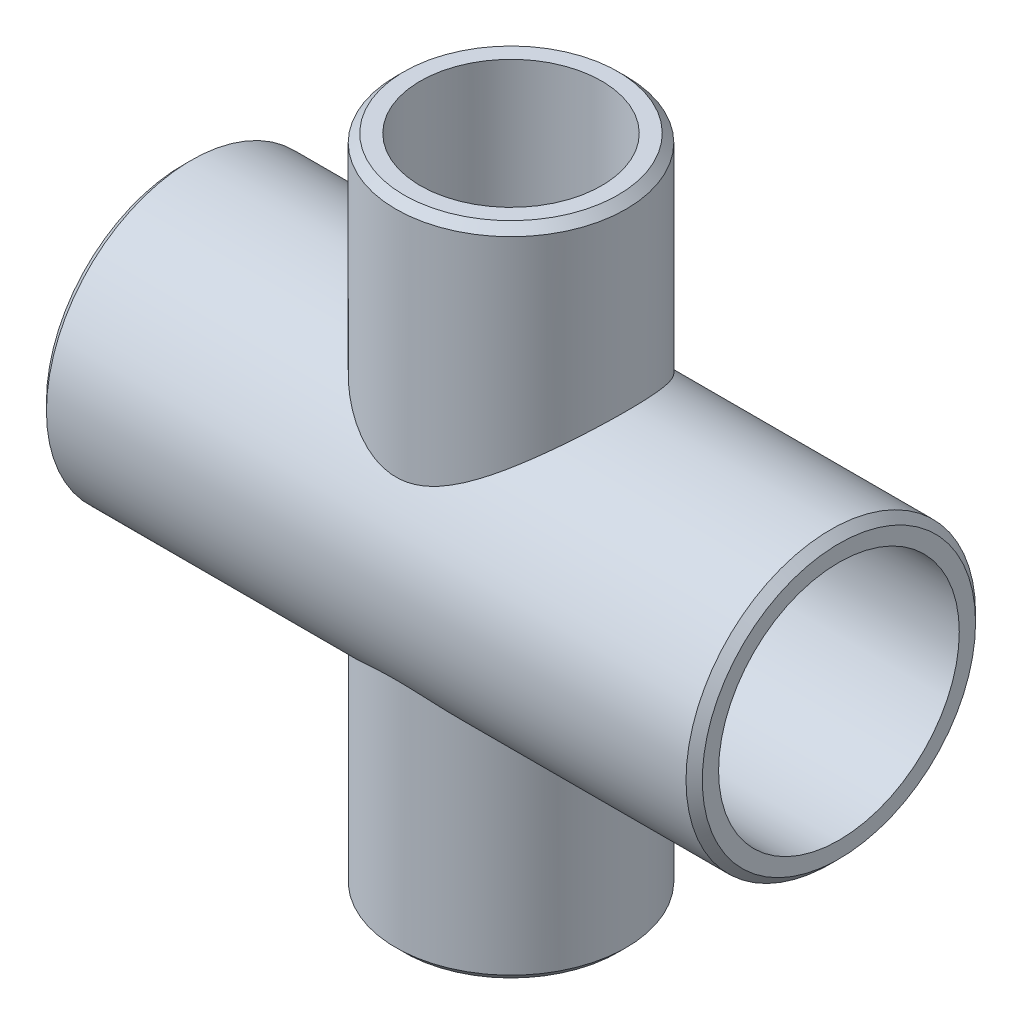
ISO-10303-21;
HEADER;
FILE_DESCRIPTION(('STEP AP214'),'2;1');
FILE_NAME('part.step','',(''),(''),'','','');
FILE_SCHEMA(('AUTOMOTIVE_DESIGN { 1 0 10303 214 1 1 1 1 }'));
ENDSEC;
DATA;
#1=APPLICATION_CONTEXT('core data for automotive mechanical design processes');
#2=APPLICATION_PROTOCOL_DEFINITION('international standard','automotive_design',2000,#1);
#3=PRODUCT_CONTEXT('',#1,'mechanical');
#4=PRODUCT('Part','Part','',(#3));
#5=PRODUCT_RELATED_PRODUCT_CATEGORY('part','',(#4));
#6=PRODUCT_DEFINITION_FORMATION('','',#4);
#7=PRODUCT_DEFINITION_CONTEXT('part definition',#1,'design');
#8=PRODUCT_DEFINITION('design','',#6,#7);
#9=PRODUCT_DEFINITION_SHAPE('','',#8);
#10=(LENGTH_UNIT() NAMED_UNIT(*) SI_UNIT(.MILLI.,.METRE.));
#11=(NAMED_UNIT(*) PLANE_ANGLE_UNIT() SI_UNIT($,.RADIAN.));
#12=(NAMED_UNIT(*) SI_UNIT($,.STERADIAN.) SOLID_ANGLE_UNIT());
#13=UNCERTAINTY_MEASURE_WITH_UNIT(LENGTH_MEASURE(1.E-05),#10,'distance_accuracy_value','');
#14=(GEOMETRIC_REPRESENTATION_CONTEXT(3) GLOBAL_UNCERTAINTY_ASSIGNED_CONTEXT((#13)) GLOBAL_UNIT_ASSIGNED_CONTEXT((#10,
#11,#12)) REPRESENTATION_CONTEXT('',''));
#15=CARTESIAN_POINT('',(0.,0.,0.));
#16=DIRECTION('',(0.,0.,1.));
#17=DIRECTION('',(1.,0.,0.));
#18=AXIS2_PLACEMENT_3D('',#15,#16,#17);
#19=CARTESIAN_POINT('',(-47.752,0.,0.));
#20=DIRECTION('',(-1.,0.,0.));
#21=DIRECTION('',(0.,0.,-1.));
#22=AXIS2_PLACEMENT_3D('',#19,#20,#21);
#23=PLANE('',#22);
#24=CARTESIAN_POINT('',(-47.752,0.,0.));
#25=DIRECTION('',(-1.,0.,0.));
#26=DIRECTION('',(0.,0.,1.));
#27=AXIS2_PLACEMENT_3D('',#24,#25,#26);
#28=CIRCLE('',#27,19.8966666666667);
#29=CARTESIAN_POINT('',(-47.752,0.,19.8966666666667));
#30=VERTEX_POINT('',#29);
#31=EDGE_CURVE('E55',#30,#30,#28,.T.);
#32=ORIENTED_EDGE('',*,*,#31,.T.);
#33=EDGE_LOOP('',(#32));
#34=FACE_BOUND('',#33,.T.);
#35=CARTESIAN_POINT('',(-47.752,0.,0.));
#36=DIRECTION('',(-1.,0.,0.));
#37=DIRECTION('',(0.,0.,1.));
#38=AXIS2_PLACEMENT_3D('',#35,#36,#37);
#39=CIRCLE('',#38,17.526);
#40=CARTESIAN_POINT('',(-47.752,0.,17.526));
#41=VERTEX_POINT('',#40);
#42=EDGE_CURVE('E111',#41,#41,#39,.F.);
#43=ORIENTED_EDGE('',*,*,#42,.T.);
#44=EDGE_LOOP('',(#43));
#45=FACE_BOUND('',#44,.T.);
#46=ADVANCED_FACE('F32',(#34,#45),#23,.T.);
#47=CARTESIAN_POINT('',(0.,-47.752,0.));
#48=DIRECTION('',(0.,-1.,0.));
#49=DIRECTION('',(0.,0.,1.));
#50=AXIS2_PLACEMENT_3D('',#47,#48,#49);
#51=PLANE('',#50);
#52=CARTESIAN_POINT('',(0.,-47.752,0.));
#53=DIRECTION('',(0.,-1.,0.));
#54=DIRECTION('',(0.,0.,-1.));
#55=AXIS2_PLACEMENT_3D('',#52,#53,#54);
#56=CIRCLE('',#55,15.5786666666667);
#57=CARTESIAN_POINT('',(0.,-47.752,-15.5786666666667));
#58=VERTEX_POINT('',#57);
#59=EDGE_CURVE('E47',#58,#58,#56,.T.);
#60=ORIENTED_EDGE('',*,*,#59,.T.);
#61=EDGE_LOOP('',(#60));
#62=FACE_BOUND('',#61,.T.);
#63=CARTESIAN_POINT('',(0.,-47.752,0.));
#64=DIRECTION('',(0.,-1.,0.));
#65=DIRECTION('',(0.,0.,-1.));
#66=AXIS2_PLACEMENT_3D('',#63,#64,#65);
#67=CIRCLE('',#66,13.208);
#68=CARTESIAN_POINT('',(0.,-47.752,-13.208));
#69=VERTEX_POINT('',#68);
#70=EDGE_CURVE('E125',#69,#69,#67,.F.);
#71=ORIENTED_EDGE('',*,*,#70,.T.);
#72=EDGE_LOOP('',(#71));
#73=FACE_BOUND('',#72,.T.);
#74=ADVANCED_FACE('F88',(#62,#73),#51,.T.);
#75=CARTESIAN_POINT('',(47.752,0.,0.));
#76=DIRECTION('',(-1.,0.,0.));
#77=DIRECTION('',(0.,0.,1.));
#78=AXIS2_PLACEMENT_3D('',#75,#76,#77);
#79=CYLINDRICAL_SURFACE('',#78,21.082);
#80=CARTESIAN_POINT('',(-46.5666666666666,0.,0.));
#81=DIRECTION('',(-1.,0.,0.));
#82=DIRECTION('',(0.,0.,1.));
#83=AXIS2_PLACEMENT_3D('',#80,#81,#82);
#84=CIRCLE('',#83,21.082);
#85=CARTESIAN_POINT('',(-46.5666666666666,0.,21.082));
#86=VERTEX_POINT('',#85);
#87=EDGE_CURVE('E58',#86,#86,#84,.F.);
#88=ORIENTED_EDGE('',*,*,#87,.T.);
#89=EDGE_LOOP('',(#88));
#90=FACE_BOUND('',#89,.T.);
#91=CARTESIAN_POINT('',(46.5666666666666,0.,0.));
#92=DIRECTION('',(1.,0.,0.));
#93=DIRECTION('',(0.,0.,-1.));
#94=AXIS2_PLACEMENT_3D('',#91,#92,#93);
#95=CIRCLE('',#94,21.082);
#96=CARTESIAN_POINT('',(46.5666666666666,0.,-21.082));
#97=VERTEX_POINT('',#96);
#98=EDGE_CURVE('E61',#97,#97,#95,.F.);
#99=ORIENTED_EDGE('',*,*,#98,.T.);
#100=EDGE_LOOP('',(#99));
#101=FACE_BOUND('',#100,.T.);
#102=CARTESIAN_POINT('',(0.,12.7835452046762,-16.764));
#103=CARTESIAN_POINT('',(-0.317697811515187,12.7835397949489,-16.7640023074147));
#104=CARTESIAN_POINT('',(-0.635369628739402,12.7954377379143,-16.7549507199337));
#105=CARTESIAN_POINT('',(-1.26793729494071,12.8423993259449,-16.7189825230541));
#106=CARTESIAN_POINT('',(-1.58283333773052,12.8774613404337,-16.6920671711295));
#107=CARTESIAN_POINT('',(-2.20808948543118,12.9691478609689,-16.6209286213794));
#108=CARTESIAN_POINT('',(-2.51843927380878,13.0258152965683,-16.5766709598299));
#109=CARTESIAN_POINT('',(-3.13218806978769,13.158258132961,-16.4717358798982));
#110=CARTESIAN_POINT('',(-3.43558583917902,13.2340369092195,-16.4110555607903));
#111=CARTESIAN_POINT('',(-4.13714477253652,13.4307826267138,-16.2507212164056));
#112=CARTESIAN_POINT('',(-4.53204059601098,13.5583293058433,-16.1448399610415));
#113=CARTESIAN_POINT('',(-5.30574547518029,13.8361618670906,-15.9073791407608));
#114=CARTESIAN_POINT('',(-5.68454810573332,13.9864567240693,-15.7757894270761));
#115=CARTESIAN_POINT('',(-6.4265606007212,14.3040905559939,-15.4883726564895));
#116=CARTESIAN_POINT('',(-6.789730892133,14.4714695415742,-15.3324882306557));
#117=CARTESIAN_POINT('',(-7.49962420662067,14.8178080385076,-14.9980428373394));
#118=CARTESIAN_POINT('',(-7.8463474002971,14.9967674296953,-14.8194821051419));
#119=CARTESIAN_POINT('',(-8.64260782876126,15.4261120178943,-14.3740062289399));
#120=CARTESIAN_POINT('',(-9.08550102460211,15.6795138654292,-14.0980815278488));
#121=CARTESIAN_POINT('',(-9.94209929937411,16.1909377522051,-13.5076644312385));
#122=CARTESIAN_POINT('',(-10.3557941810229,16.4489613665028,-13.1931586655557));
#123=CARTESIAN_POINT('',(-11.1529299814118,16.9621344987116,-12.526514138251));
#124=CARTESIAN_POINT('',(-11.5363945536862,17.2172861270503,-12.1744053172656));
#125=CARTESIAN_POINT('',(-12.2717293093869,17.7184101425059,-11.4327974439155));
#126=CARTESIAN_POINT('',(-12.6236097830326,17.9643855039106,-11.0433106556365));
#127=CARTESIAN_POINT('',(-13.2278088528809,18.3945171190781,-10.3071362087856));
#128=CARTESIAN_POINT('',(-13.4861491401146,18.5813634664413,-9.96694943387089));
#129=CARTESIAN_POINT('',(-13.9789418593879,18.9420603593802,-9.26311973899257));
#130=CARTESIAN_POINT('',(-14.2133953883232,19.1159115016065,-8.89947789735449));
#131=CARTESIAN_POINT('',(-14.6559634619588,19.4472314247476,-8.15006473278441));
#132=CARTESIAN_POINT('',(-14.864110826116,19.6047205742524,-7.76432187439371));
#133=CARTESIAN_POINT('',(-15.251948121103,19.9003818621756,-6.97168089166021));
#134=CARTESIAN_POINT('',(-15.4316427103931,20.0385571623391,-6.56478624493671));
#135=CARTESIAN_POINT('',(-15.7336935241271,20.272161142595,-5.79861640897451));
#136=CARTESIAN_POINT('',(-15.8606236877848,20.3708918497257,-5.44214666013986));
#137=CARTESIAN_POINT('',(-16.0910657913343,20.5508208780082,-4.71739680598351));
#138=CARTESIAN_POINT('',(-16.1945801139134,20.6320209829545,-4.34911790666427));
#139=CARTESIAN_POINT('',(-16.3767486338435,20.7753161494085,-3.60294646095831));
#140=CARTESIAN_POINT('',(-16.4554121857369,20.8374183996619,-3.22505759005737));
#141=CARTESIAN_POINT('',(-16.5867441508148,20.9412867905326,-2.46200567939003));
#142=CARTESIAN_POINT('',(-16.6394122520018,20.9830526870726,-2.07684255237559));
#143=CARTESIAN_POINT('',(-16.7180256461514,21.0454468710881,-1.30074868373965));
#144=CARTESIAN_POINT('',(-16.7438791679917,21.0660025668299,-0.909802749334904));
#145=CARTESIAN_POINT('',(-16.7681011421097,21.0852600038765,-0.126517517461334));
#146=CARTESIAN_POINT('',(-16.7664695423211,21.0839617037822,0.265821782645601));
#147=CARTESIAN_POINT('',(-16.7357495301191,21.0595406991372,1.04875085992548));
#148=CARTESIAN_POINT('',(-16.706659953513,21.0364170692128,1.43934056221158));
#149=CARTESIAN_POINT('',(-16.621519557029,20.9688642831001,2.21568809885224));
#150=CARTESIAN_POINT('',(-16.5654693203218,20.9244355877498,2.60144603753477));
#151=CARTESIAN_POINT('',(-16.4309848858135,20.8181337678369,3.34508334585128));
#152=CARTESIAN_POINT('',(-16.3538923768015,20.7573083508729,3.70335765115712));
#153=CARTESIAN_POINT('',(-16.1773981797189,20.6185418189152,4.41094569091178));
#154=CARTESIAN_POINT('',(-16.077997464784,20.5406014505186,4.76025981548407));
#155=CARTESIAN_POINT('',(-15.8580945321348,20.3689339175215,5.44820784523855));
#156=CARTESIAN_POINT('',(-15.7375904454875,20.2752053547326,5.78684080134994));
#157=CARTESIAN_POINT('',(-15.4767822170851,20.0734398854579,6.45202039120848));
#158=CARTESIAN_POINT('',(-15.3364753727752,19.9654010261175,6.77856536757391));
#159=CARTESIAN_POINT('',(-15.0228021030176,19.7254260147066,7.44965451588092));
#160=CARTESIAN_POINT('',(-14.8475460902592,19.5921868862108,7.79284882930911));
#161=CARTESIAN_POINT('',(-14.4764644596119,19.3124877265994,8.46227926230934));
#162=CARTESIAN_POINT('',(-14.2806377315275,19.166026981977,8.7885144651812));
#163=CARTESIAN_POINT('',(-13.8698741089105,18.8619552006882,9.42344498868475));
#164=CARTESIAN_POINT('',(-13.6549299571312,18.7043399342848,9.73213357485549));
#165=CARTESIAN_POINT('',(-13.2073234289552,18.3801146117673,10.3314186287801));
#166=CARTESIAN_POINT('',(-12.9746590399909,18.2135035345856,10.6220130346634));
#167=CARTESIAN_POINT('',(-12.4432026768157,17.8384389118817,11.242682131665));
#168=CARTESIAN_POINT('',(-12.1406473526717,17.6284231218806,11.5685970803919));
#169=CARTESIAN_POINT('',(-11.5129119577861,17.2021235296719,12.1934717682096));
#170=CARTESIAN_POINT('',(-11.1877281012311,16.9858386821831,12.492426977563));
#171=CARTESIAN_POINT('',(-10.5153773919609,16.5507219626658,13.063433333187));
#172=CARTESIAN_POINT('',(-10.1681865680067,16.3318875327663,13.335454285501));
#173=CARTESIAN_POINT('',(-9.45265950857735,15.8962634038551,13.8518439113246));
#174=CARTESIAN_POINT('',(-9.08432600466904,15.679473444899,14.0962161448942));
#175=CARTESIAN_POINT('',(-8.36787695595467,15.2762097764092,14.5315630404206));
#176=CARTESIAN_POINT('',(-8.02194224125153,15.0890096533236,14.7254546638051));
#177=CARTESIAN_POINT('',(-7.31301101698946,14.7243582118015,15.090078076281));
#178=CARTESIAN_POINT('',(-6.9500128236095,14.5469078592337,15.2608075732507));
#179=CARTESIAN_POINT('',(-6.20740255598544,14.2071125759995,15.5776295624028));
#180=CARTESIAN_POINT('',(-5.8278202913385,14.0447420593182,15.7237641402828));
#181=CARTESIAN_POINT('',(-5.05158180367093,13.7408207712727,15.9900403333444));
#182=CARTESIAN_POINT('',(-4.65493306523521,13.5992609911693,16.110193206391));
#183=CARTESIAN_POINT('',(-3.96326940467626,13.3810469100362,16.2914762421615));
#184=CARTESIAN_POINT('',(-3.67225862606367,13.2974913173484,16.3596081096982));
#185=CARTESIAN_POINT('',(-3.08293863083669,13.1469561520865,16.4808257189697));
#186=CARTESIAN_POINT('',(-2.78463176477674,13.0799713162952,16.5339162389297));
#187=CARTESIAN_POINT('',(-2.18248354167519,12.9651500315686,16.6241076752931));
#188=CARTESIAN_POINT('',(-1.87865282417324,12.917280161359,16.6612365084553));
#189=CARTESIAN_POINT('',(-1.26682259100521,12.8425748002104,16.718888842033));
#190=CARTESIAN_POINT('',(-0.958823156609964,12.8157388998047,16.739412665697));
#191=CARTESIAN_POINT('',(-0.339369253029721,12.7842887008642,16.7634451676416));
#192=CARTESIAN_POINT('',(-0.0279051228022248,12.7797930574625,16.7668629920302));
#193=CARTESIAN_POINT('',(0.594212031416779,12.7935683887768,16.7563540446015));
#194=CARTESIAN_POINT('',(0.904865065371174,12.8118390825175,16.7424274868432));
#195=CARTESIAN_POINT('',(1.52322063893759,12.8702891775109,16.697536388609));
#196=CARTESIAN_POINT('',(1.83091905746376,12.9104956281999,16.6665508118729));
#197=CARTESIAN_POINT('',(2.44088210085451,13.0110089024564,16.5882007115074));
#198=CARTESIAN_POINT('',(2.74314588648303,13.071318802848,16.5408336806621));
#199=CARTESIAN_POINT('',(3.42045800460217,13.2281130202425,16.4158551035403));
#200=CARTESIAN_POINT('',(3.79339936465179,13.3299561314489,16.3335454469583));
#201=CARTESIAN_POINT('',(4.52619802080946,13.5566913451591,16.1458493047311));
#202=CARTESIAN_POINT('',(4.88605107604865,13.6815908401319,16.0404554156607));
#203=CARTESIAN_POINT('',(5.59270751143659,13.9495599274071,15.8079731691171));
#204=CARTESIAN_POINT('',(5.93947726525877,14.0926726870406,15.6808330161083));
#205=CARTESIAN_POINT('',(6.61890038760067,14.3922173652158,15.4063658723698));
#206=CARTESIAN_POINT('',(6.95155317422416,14.5486498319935,15.2590380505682));
#207=CARTESIAN_POINT('',(7.74564544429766,14.9414874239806,14.876394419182));
#208=CARTESIAN_POINT('',(8.19967668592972,15.1829101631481,14.6308036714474));
#209=CARTESIAN_POINT('',(9.07951478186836,15.6755825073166,14.1016923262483));
#210=CARTESIAN_POINT('',(9.50531052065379,15.9268359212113,13.8181569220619));
#211=CARTESIAN_POINT('',(10.3289131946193,16.4316643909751,13.2138676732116));
#212=CARTESIAN_POINT('',(10.7266936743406,16.6852413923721,12.893079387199));
#213=CARTESIAN_POINT('',(11.4928777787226,17.1878374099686,12.2150354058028));
#214=CARTESIAN_POINT('',(11.8612858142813,17.4368571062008,11.8577852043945));
#215=CARTESIAN_POINT('',(12.5712159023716,17.9272948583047,11.1026085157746));
#216=CARTESIAN_POINT('',(12.9123644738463,18.1685866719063,10.7042473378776));
#217=CARTESIAN_POINT('',(13.5599963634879,18.6344295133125,9.87100225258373));
#218=CARTESIAN_POINT('',(13.8664743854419,18.8589779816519,9.43611278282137));
#219=CARTESIAN_POINT('',(14.4402093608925,19.2847561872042,8.53214931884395));
#220=CARTESIAN_POINT('',(14.7075725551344,19.4860487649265,8.06317330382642));
#221=CARTESIAN_POINT('',(15.0763686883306,19.7663752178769,7.33544744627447));
#222=CARTESIAN_POINT('',(15.1939101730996,19.8562030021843,7.08886877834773));
#223=CARTESIAN_POINT('',(15.4177406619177,20.0279953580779,6.58788584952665));
#224=CARTESIAN_POINT('',(15.5240270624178,20.1099581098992,6.33347979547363));
#225=CARTESIAN_POINT('',(15.7600600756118,20.292637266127,5.72646099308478));
#226=CARTESIAN_POINT('',(15.8848766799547,20.3897852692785,5.37083086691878));
#227=CARTESIAN_POINT('',(16.1111890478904,20.5665858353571,4.6480793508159));
#228=CARTESIAN_POINT('',(16.2126908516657,20.6462429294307,4.28096096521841));
#229=CARTESIAN_POINT('',(16.3909920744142,20.7865490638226,3.53739204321));
#230=CARTESIAN_POINT('',(16.4678045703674,20.8472081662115,3.16094656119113));
#231=CARTESIAN_POINT('',(16.5956437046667,20.9483385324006,2.40099304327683));
#232=CARTESIAN_POINT('',(16.646669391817,20.9888090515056,2.01748474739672));
#233=CARTESIAN_POINT('',(16.7222313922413,21.0487890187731,1.24491407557));
#234=CARTESIAN_POINT('',(16.7466779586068,21.0682274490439,0.855837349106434));
#235=CARTESIAN_POINT('',(16.768357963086,21.085464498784,0.0764454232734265));
#236=CARTESIAN_POINT('',(16.765591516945,21.0832632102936,-0.313869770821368));
#237=CARTESIAN_POINT('',(16.7328925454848,21.0572700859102,-1.0926683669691));
#238=CARTESIAN_POINT('',(16.7029574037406,21.033476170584,-1.48115158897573));
#239=CARTESIAN_POINT('',(16.6164232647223,20.9648242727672,-2.25323669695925));
#240=CARTESIAN_POINT('',(16.5598247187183,20.9199666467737,-2.63683866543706));
#241=CARTESIAN_POINT('',(16.4242160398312,20.8127908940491,-3.37815751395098));
#242=CARTESIAN_POINT('',(16.3464116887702,20.7514139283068,-3.73623320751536));
#243=CARTESIAN_POINT('',(16.1685231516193,20.6115779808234,-4.44336313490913));
#244=CARTESIAN_POINT('',(16.0684398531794,20.533119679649,-4.79241772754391));
#245=CARTESIAN_POINT('',(15.8472053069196,20.3604558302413,-5.47979615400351));
#246=CARTESIAN_POINT('',(15.7260521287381,20.2662488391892,-5.81811900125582));
#247=CARTESIAN_POINT('',(15.4639814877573,20.0635702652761,-6.4826365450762));
#248=CARTESIAN_POINT('',(15.3230613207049,19.9550967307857,-6.80882957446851));
#249=CARTESIAN_POINT('',(15.0079684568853,19.7141279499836,-7.47950936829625));
#250=CARTESIAN_POINT('',(14.8318868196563,19.580318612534,-7.8226264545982));
#251=CARTESIAN_POINT('',(14.4591535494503,19.2995110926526,-8.49183762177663));
#252=CARTESIAN_POINT('',(14.2625007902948,19.1525121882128,-8.81793076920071));
#253=CARTESIAN_POINT('',(13.8500799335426,18.8473997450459,-9.45252595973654));
#254=CARTESIAN_POINT('',(13.6343041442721,18.6892817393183,-9.76102084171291));
#255=CARTESIAN_POINT('',(13.185031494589,18.3640970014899,-10.3598643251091));
#256=CARTESIAN_POINT('',(12.9515326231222,18.1970292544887,-10.6502108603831));
#257=CARTESIAN_POINT('',(12.418098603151,17.8209250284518,-11.2704287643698));
#258=CARTESIAN_POINT('',(12.1143878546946,17.6103340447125,-11.5961170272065));
#259=CARTESIAN_POINT('',(11.4843039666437,17.1829751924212,-12.2204429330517));
#260=CARTESIAN_POINT('',(11.1579270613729,16.9662063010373,-12.5190760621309));
#261=CARTESIAN_POINT('',(10.4831908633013,16.5302725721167,-13.0892975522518));
#262=CARTESIAN_POINT('',(10.1348108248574,16.3111056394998,-13.3608597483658));
#263=CARTESIAN_POINT('',(9.41684827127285,15.8749703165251,-13.8762364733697));
#264=CARTESIAN_POINT('',(9.04726834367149,15.6580016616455,-14.1200543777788));
#265=CARTESIAN_POINT('',(8.33051656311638,15.2557849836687,-14.5529639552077));
#266=CARTESIAN_POINT('',(7.98563845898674,15.0697535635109,-14.7451250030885));
#267=CARTESIAN_POINT('',(7.27901123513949,14.7075136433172,-15.106462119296));
#268=CARTESIAN_POINT('',(6.91726125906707,14.5313056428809,-15.2756370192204));
#269=CARTESIAN_POINT('',(6.17695660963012,14.1938515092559,-15.5896872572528));
#270=CARTESIAN_POINT('',(5.79841888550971,14.0325907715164,-15.734586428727));
#271=CARTESIAN_POINT('',(5.21804041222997,13.8063499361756,-15.9325297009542));
#272=CARTESIAN_POINT('',(5.02250425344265,13.7335507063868,-15.9952716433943));
#273=CARTESIAN_POINT('',(4.6272051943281,13.5939629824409,-16.1140711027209));
#274=CARTESIAN_POINT('',(4.42744073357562,13.5271767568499,-16.1701260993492));
#275=CARTESIAN_POINT('',(3.8900851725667,13.3585307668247,-16.310092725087));
#276=CARTESIAN_POINT('',(3.5489068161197,13.2627666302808,-16.3878400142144));
#277=CARTESIAN_POINT('',(2.85690874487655,13.0945963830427,-16.5225278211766));
#278=CARTESIAN_POINT('',(2.50609315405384,13.0221804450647,-16.5794770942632));
#279=CARTESIAN_POINT('',(1.79804487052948,12.9046727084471,-16.6711045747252));
#280=CARTESIAN_POINT('',(1.44083424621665,12.8595006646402,-16.705848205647));
#281=CARTESIAN_POINT('',(0.722404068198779,12.7989426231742,-16.7522925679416));
#282=CARTESIAN_POINT('',(0.361185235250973,12.7835513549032,-16.7639973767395));
#283=CARTESIAN_POINT('',(0.,12.7835452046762,-16.764));
#284=B_SPLINE_CURVE_WITH_KNOTS('',3,(#102,#103,#104,#105,#106,#107,#108,#109,#110,#111,#112,
#113,#114,#115,#116,#117,#118,#119,#120,#121,#122,#123,#124,#125,#126,#127,#128,#129,#130,#131,
#132,#133,#134,#135,#136,#137,#138,#139,#140,#141,#142,#143,#144,#145,#146,#147,#148,#149,#150,
#151,#152,#153,#154,#155,#156,#157,#158,#159,#160,#161,#162,#163,#164,#165,#166,#167,#168,#169,
#170,#171,#172,#173,#174,#175,#176,#177,#178,#179,#180,#181,#182,#183,#184,#185,#186,#187,#188,
#189,#190,#191,#192,#193,#194,#195,#196,#197,#198,#199,#200,#201,#202,#203,#204,#205,#206,#207,
#208,#209,#210,#211,#212,#213,#214,#215,#216,#217,#218,#219,#220,#221,#222,#223,#224,#225,#226,
#227,#228,#229,#230,#231,#232,#233,#234,#235,#236,#237,#238,#239,#240,#241,#242,#243,#244,#245,
#246,#247,#248,#249,#250,#251,#252,#253,#254,#255,#256,#257,#258,#259,#260,#261,#262,#263,#264,
#265,#266,#267,#268,#269,#270,#271,#272,#273,#274,#275,#276,#277,#278,#279,#280,#281,#282,#283),
.UNSPECIFIED.,.T.,.F.,(4,2,2,2,2,2,2,2,2,2,2,2,2,2,2,2,2,2,2,2,2,2,2,2,2,2,2,2,2,2,2,2,2,2,2,2,
2,2,2,2,2,2,2,2,2,2,2,2,2,2,2,2,2,2,2,2,2,2,2,2,2,2,2,2,2,2,2,2,2,2,2,2,2,2,2,2,2,2,2,2,2,2,2,2,
2,2,2,2,2,2,4),(0.,0.952705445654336,1.90534383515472,2.85988504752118,3.81459497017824,
5.09739870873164,6.38070987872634,7.66709867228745,8.95347411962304,10.6915056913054,
12.4301412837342,14.1674027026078,15.9040960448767,17.3015541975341,18.6989481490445,
20.0945811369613,21.4899853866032,22.6619889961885,23.8338732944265,25.0053159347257,
26.176772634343,27.3522254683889,28.5276805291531,29.7031854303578,30.8786649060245,
31.9919313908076,33.1051493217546,34.2184658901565,35.3319345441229,36.5539800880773,
37.7760916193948,38.998669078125,40.2213855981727,41.6953866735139,43.1696349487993,
44.645517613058,46.1212100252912,47.4358453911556,48.7506107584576,50.0631029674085,
51.3750253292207,52.3052699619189,53.2352187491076,54.1635343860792,55.0918319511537,
56.0250547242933,56.9582659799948,57.8926306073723,58.8271383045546,60.0110790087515,
61.1953999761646,62.3825820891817,63.569813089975,65.2770466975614,66.9849484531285,
68.6944419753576,70.4036782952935,72.1333200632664,73.8632256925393,75.5883417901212,
76.4506315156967,77.3131202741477,78.4795187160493,79.6456146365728,80.8110918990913,
81.9766121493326,83.1460557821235,84.3154944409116,85.4850457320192,86.6545772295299,
87.7679870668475,88.8813525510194,89.9948200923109,91.1084401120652,92.331916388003,
93.5554596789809,94.7794973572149,96.0036741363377,97.4800936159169,98.9567589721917,
100.434838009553,101.912737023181,103.221080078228,104.52948961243,105.836606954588,
106.49004489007,107.143728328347,108.23070890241,109.317231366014,110.400537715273,
111.483652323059),.UNSPECIFIED.);
#285=CARTESIAN_POINT('',(0.,12.7835452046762,-16.764));
#286=VERTEX_POINT('',#285);
#287=EDGE_CURVE('E71',#286,#286,#284,.T.);
#288=ORIENTED_EDGE('',*,*,#287,.F.);
#289=EDGE_LOOP('',(#288));
#290=FACE_BOUND('',#289,.T.);
#291=CARTESIAN_POINT('',(0.,-12.7835452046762,-16.764));
#292=CARTESIAN_POINT('',(0.317697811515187,-12.7835397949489,-16.7640023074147));
#293=CARTESIAN_POINT('',(0.635369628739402,-12.7954377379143,-16.7549507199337));
#294=CARTESIAN_POINT('',(1.26793729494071,-12.8423993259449,-16.7189825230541));
#295=CARTESIAN_POINT('',(1.58283333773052,-12.8774613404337,-16.6920671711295));
#296=CARTESIAN_POINT('',(2.20808948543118,-12.9691478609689,-16.6209286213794));
#297=CARTESIAN_POINT('',(2.51843927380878,-13.0258152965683,-16.5766709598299));
#298=CARTESIAN_POINT('',(3.13218806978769,-13.158258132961,-16.4717358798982));
#299=CARTESIAN_POINT('',(3.43558583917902,-13.2340369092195,-16.4110555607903));
#300=CARTESIAN_POINT('',(4.13714477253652,-13.4307826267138,-16.2507212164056));
#301=CARTESIAN_POINT('',(4.53204059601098,-13.5583293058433,-16.1448399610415));
#302=CARTESIAN_POINT('',(5.30574547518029,-13.8361618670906,-15.9073791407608));
#303=CARTESIAN_POINT('',(5.68454810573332,-13.9864567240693,-15.7757894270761));
#304=CARTESIAN_POINT('',(6.4265606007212,-14.3040905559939,-15.4883726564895));
#305=CARTESIAN_POINT('',(6.789730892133,-14.4714695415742,-15.3324882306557));
#306=CARTESIAN_POINT('',(7.49962420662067,-14.8178080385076,-14.9980428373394));
#307=CARTESIAN_POINT('',(7.8463474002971,-14.9967674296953,-14.8194821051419));
#308=CARTESIAN_POINT('',(8.64260782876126,-15.4261120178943,-14.3740062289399));
#309=CARTESIAN_POINT('',(9.08550102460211,-15.6795138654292,-14.0980815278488));
#310=CARTESIAN_POINT('',(9.94209929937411,-16.1909377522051,-13.5076644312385));
#311=CARTESIAN_POINT('',(10.3557941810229,-16.4489613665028,-13.1931586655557));
#312=CARTESIAN_POINT('',(11.1529299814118,-16.9621344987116,-12.526514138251));
#313=CARTESIAN_POINT('',(11.5363945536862,-17.2172861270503,-12.1744053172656));
#314=CARTESIAN_POINT('',(12.2717293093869,-17.7184101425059,-11.4327974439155));
#315=CARTESIAN_POINT('',(12.6236097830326,-17.9643855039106,-11.0433106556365));
#316=CARTESIAN_POINT('',(13.2278088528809,-18.3945171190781,-10.3071362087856));
#317=CARTESIAN_POINT('',(13.4861491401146,-18.5813634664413,-9.96694943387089));
#318=CARTESIAN_POINT('',(13.9789418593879,-18.9420603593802,-9.26311973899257));
#319=CARTESIAN_POINT('',(14.2133953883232,-19.1159115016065,-8.89947789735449));
#320=CARTESIAN_POINT('',(14.6559634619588,-19.4472314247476,-8.15006473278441));
#321=CARTESIAN_POINT('',(14.864110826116,-19.6047205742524,-7.76432187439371));
#322=CARTESIAN_POINT('',(15.251948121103,-19.9003818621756,-6.97168089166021));
#323=CARTESIAN_POINT('',(15.4316427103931,-20.0385571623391,-6.56478624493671));
#324=CARTESIAN_POINT('',(15.7336935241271,-20.272161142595,-5.79861640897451));
#325=CARTESIAN_POINT('',(15.8606236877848,-20.3708918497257,-5.44214666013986));
#326=CARTESIAN_POINT('',(16.0910657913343,-20.5508208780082,-4.71739680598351));
#327=CARTESIAN_POINT('',(16.1945801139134,-20.6320209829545,-4.34911790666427));
#328=CARTESIAN_POINT('',(16.3767486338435,-20.7753161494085,-3.60294646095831));
#329=CARTESIAN_POINT('',(16.4554121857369,-20.8374183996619,-3.22505759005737));
#330=CARTESIAN_POINT('',(16.5867441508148,-20.9412867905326,-2.46200567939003));
#331=CARTESIAN_POINT('',(16.6394122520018,-20.9830526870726,-2.07684255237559));
#332=CARTESIAN_POINT('',(16.7180256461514,-21.0454468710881,-1.30074868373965));
#333=CARTESIAN_POINT('',(16.7438791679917,-21.0660025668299,-0.909802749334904));
#334=CARTESIAN_POINT('',(16.7681011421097,-21.0852600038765,-0.126517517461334));
#335=CARTESIAN_POINT('',(16.7664695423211,-21.0839617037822,0.265821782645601));
#336=CARTESIAN_POINT('',(16.7357495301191,-21.0595406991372,1.04875085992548));
#337=CARTESIAN_POINT('',(16.706659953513,-21.0364170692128,1.43934056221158));
#338=CARTESIAN_POINT('',(16.621519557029,-20.9688642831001,2.21568809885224));
#339=CARTESIAN_POINT('',(16.5654693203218,-20.9244355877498,2.60144603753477));
#340=CARTESIAN_POINT('',(16.4309848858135,-20.8181337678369,3.34508334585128));
#341=CARTESIAN_POINT('',(16.3538923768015,-20.7573083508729,3.70335765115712));
#342=CARTESIAN_POINT('',(16.1773981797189,-20.6185418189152,4.41094569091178));
#343=CARTESIAN_POINT('',(16.077997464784,-20.5406014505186,4.76025981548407));
#344=CARTESIAN_POINT('',(15.8580945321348,-20.3689339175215,5.44820784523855));
#345=CARTESIAN_POINT('',(15.7375904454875,-20.2752053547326,5.78684080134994));
#346=CARTESIAN_POINT('',(15.4767822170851,-20.0734398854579,6.45202039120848));
#347=CARTESIAN_POINT('',(15.3364753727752,-19.9654010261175,6.77856536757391));
#348=CARTESIAN_POINT('',(15.0228021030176,-19.7254260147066,7.44965451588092));
#349=CARTESIAN_POINT('',(14.8475460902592,-19.5921868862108,7.79284882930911));
#350=CARTESIAN_POINT('',(14.4764644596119,-19.3124877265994,8.46227926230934));
#351=CARTESIAN_POINT('',(14.2806377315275,-19.166026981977,8.7885144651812));
#352=CARTESIAN_POINT('',(13.8698741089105,-18.8619552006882,9.42344498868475));
#353=CARTESIAN_POINT('',(13.6549299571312,-18.7043399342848,9.73213357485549));
#354=CARTESIAN_POINT('',(13.2073234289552,-18.3801146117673,10.3314186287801));
#355=CARTESIAN_POINT('',(12.9746590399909,-18.2135035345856,10.6220130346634));
#356=CARTESIAN_POINT('',(12.4432026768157,-17.8384389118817,11.242682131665));
#357=CARTESIAN_POINT('',(12.1406473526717,-17.6284231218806,11.5685970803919));
#358=CARTESIAN_POINT('',(11.5129119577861,-17.2021235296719,12.1934717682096));
#359=CARTESIAN_POINT('',(11.1877281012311,-16.9858386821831,12.492426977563));
#360=CARTESIAN_POINT('',(10.5153773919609,-16.5507219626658,13.063433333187));
#361=CARTESIAN_POINT('',(10.1681865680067,-16.3318875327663,13.335454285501));
#362=CARTESIAN_POINT('',(9.45265950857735,-15.8962634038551,13.8518439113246));
#363=CARTESIAN_POINT('',(9.08432600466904,-15.679473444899,14.0962161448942));
#364=CARTESIAN_POINT('',(8.36787695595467,-15.2762097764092,14.5315630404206));
#365=CARTESIAN_POINT('',(8.02194224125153,-15.0890096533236,14.7254546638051));
#366=CARTESIAN_POINT('',(7.31301101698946,-14.7243582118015,15.090078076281));
#367=CARTESIAN_POINT('',(6.9500128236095,-14.5469078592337,15.2608075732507));
#368=CARTESIAN_POINT('',(6.20740255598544,-14.2071125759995,15.5776295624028));
#369=CARTESIAN_POINT('',(5.8278202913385,-14.0447420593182,15.7237641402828));
#370=CARTESIAN_POINT('',(5.05158180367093,-13.7408207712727,15.9900403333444));
#371=CARTESIAN_POINT('',(4.65493306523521,-13.5992609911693,16.110193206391));
#372=CARTESIAN_POINT('',(3.96326940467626,-13.3810469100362,16.2914762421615));
#373=CARTESIAN_POINT('',(3.67225862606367,-13.2974913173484,16.3596081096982));
#374=CARTESIAN_POINT('',(3.08293863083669,-13.1469561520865,16.4808257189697));
#375=CARTESIAN_POINT('',(2.78463176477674,-13.0799713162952,16.5339162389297));
#376=CARTESIAN_POINT('',(2.18248354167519,-12.9651500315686,16.6241076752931));
#377=CARTESIAN_POINT('',(1.87865282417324,-12.917280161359,16.6612365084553));
#378=CARTESIAN_POINT('',(1.26682259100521,-12.8425748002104,16.718888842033));
#379=CARTESIAN_POINT('',(0.958823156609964,-12.8157388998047,16.739412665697));
#380=CARTESIAN_POINT('',(0.339369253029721,-12.7842887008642,16.7634451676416));
#381=CARTESIAN_POINT('',(0.0279051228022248,-12.7797930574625,16.7668629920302));
#382=CARTESIAN_POINT('',(-0.594212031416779,-12.7935683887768,16.7563540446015));
#383=CARTESIAN_POINT('',(-0.904865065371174,-12.8118390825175,16.7424274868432));
#384=CARTESIAN_POINT('',(-1.52322063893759,-12.8702891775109,16.697536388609));
#385=CARTESIAN_POINT('',(-1.83091905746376,-12.9104956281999,16.6665508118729));
#386=CARTESIAN_POINT('',(-2.44088210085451,-13.0110089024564,16.5882007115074));
#387=CARTESIAN_POINT('',(-2.74314588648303,-13.071318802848,16.5408336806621));
#388=CARTESIAN_POINT('',(-3.42045800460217,-13.2281130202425,16.4158551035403));
#389=CARTESIAN_POINT('',(-3.79339936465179,-13.3299561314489,16.3335454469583));
#390=CARTESIAN_POINT('',(-4.52619802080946,-13.5566913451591,16.1458493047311));
#391=CARTESIAN_POINT('',(-4.88605107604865,-13.6815908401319,16.0404554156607));
#392=CARTESIAN_POINT('',(-5.59270751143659,-13.9495599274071,15.8079731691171));
#393=CARTESIAN_POINT('',(-5.93947726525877,-14.0926726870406,15.6808330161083));
#394=CARTESIAN_POINT('',(-6.61890038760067,-14.3922173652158,15.4063658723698));
#395=CARTESIAN_POINT('',(-6.95155317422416,-14.5486498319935,15.2590380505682));
#396=CARTESIAN_POINT('',(-7.74564544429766,-14.9414874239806,14.876394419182));
#397=CARTESIAN_POINT('',(-8.19967668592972,-15.1829101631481,14.6308036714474));
#398=CARTESIAN_POINT('',(-9.07951478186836,-15.6755825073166,14.1016923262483));
#399=CARTESIAN_POINT('',(-9.50531052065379,-15.9268359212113,13.8181569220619));
#400=CARTESIAN_POINT('',(-10.3289131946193,-16.4316643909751,13.2138676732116));
#401=CARTESIAN_POINT('',(-10.7266936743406,-16.6852413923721,12.893079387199));
#402=CARTESIAN_POINT('',(-11.4928777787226,-17.1878374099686,12.2150354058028));
#403=CARTESIAN_POINT('',(-11.8612858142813,-17.4368571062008,11.8577852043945));
#404=CARTESIAN_POINT('',(-12.5712159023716,-17.9272948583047,11.1026085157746));
#405=CARTESIAN_POINT('',(-12.9123644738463,-18.1685866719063,10.7042473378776));
#406=CARTESIAN_POINT('',(-13.5599963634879,-18.6344295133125,9.87100225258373));
#407=CARTESIAN_POINT('',(-13.8664743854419,-18.8589779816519,9.43611278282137));
#408=CARTESIAN_POINT('',(-14.4402093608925,-19.2847561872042,8.53214931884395));
#409=CARTESIAN_POINT('',(-14.7075725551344,-19.4860487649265,8.06317330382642));
#410=CARTESIAN_POINT('',(-15.0763686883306,-19.7663752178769,7.33544744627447));
#411=CARTESIAN_POINT('',(-15.1939101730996,-19.8562030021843,7.08886877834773));
#412=CARTESIAN_POINT('',(-15.4177406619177,-20.0279953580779,6.58788584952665));
#413=CARTESIAN_POINT('',(-15.5240270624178,-20.1099581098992,6.33347979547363));
#414=CARTESIAN_POINT('',(-15.7600600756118,-20.292637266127,5.72646099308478));
#415=CARTESIAN_POINT('',(-15.8848766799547,-20.3897852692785,5.37083086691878));
#416=CARTESIAN_POINT('',(-16.1111890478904,-20.5665858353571,4.6480793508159));
#417=CARTESIAN_POINT('',(-16.2126908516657,-20.6462429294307,4.28096096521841));
#418=CARTESIAN_POINT('',(-16.3909920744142,-20.7865490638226,3.53739204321));
#419=CARTESIAN_POINT('',(-16.4678045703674,-20.8472081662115,3.16094656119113));
#420=CARTESIAN_POINT('',(-16.5956437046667,-20.9483385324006,2.40099304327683));
#421=CARTESIAN_POINT('',(-16.646669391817,-20.9888090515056,2.01748474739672));
#422=CARTESIAN_POINT('',(-16.7222313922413,-21.0487890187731,1.24491407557));
#423=CARTESIAN_POINT('',(-16.7466779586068,-21.0682274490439,0.855837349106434));
#424=CARTESIAN_POINT('',(-16.768357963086,-21.085464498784,0.0764454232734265));
#425=CARTESIAN_POINT('',(-16.765591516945,-21.0832632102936,-0.313869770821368));
#426=CARTESIAN_POINT('',(-16.7328925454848,-21.0572700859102,-1.0926683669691));
#427=CARTESIAN_POINT('',(-16.7029574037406,-21.033476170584,-1.48115158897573));
#428=CARTESIAN_POINT('',(-16.6164232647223,-20.9648242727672,-2.25323669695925));
#429=CARTESIAN_POINT('',(-16.5598247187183,-20.9199666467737,-2.63683866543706));
#430=CARTESIAN_POINT('',(-16.4242160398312,-20.8127908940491,-3.37815751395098));
#431=CARTESIAN_POINT('',(-16.3464116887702,-20.7514139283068,-3.73623320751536));
#432=CARTESIAN_POINT('',(-16.1685231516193,-20.6115779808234,-4.44336313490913));
#433=CARTESIAN_POINT('',(-16.0684398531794,-20.533119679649,-4.79241772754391));
#434=CARTESIAN_POINT('',(-15.8472053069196,-20.3604558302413,-5.47979615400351));
#435=CARTESIAN_POINT('',(-15.7260521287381,-20.2662488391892,-5.81811900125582));
#436=CARTESIAN_POINT('',(-15.4639814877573,-20.0635702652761,-6.4826365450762));
#437=CARTESIAN_POINT('',(-15.3230613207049,-19.9550967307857,-6.80882957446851));
#438=CARTESIAN_POINT('',(-15.0079684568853,-19.7141279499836,-7.47950936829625));
#439=CARTESIAN_POINT('',(-14.8318868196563,-19.580318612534,-7.8226264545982));
#440=CARTESIAN_POINT('',(-14.4591535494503,-19.2995110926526,-8.49183762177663));
#441=CARTESIAN_POINT('',(-14.2625007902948,-19.1525121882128,-8.81793076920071));
#442=CARTESIAN_POINT('',(-13.8500799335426,-18.8473997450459,-9.45252595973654));
#443=CARTESIAN_POINT('',(-13.6343041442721,-18.6892817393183,-9.76102084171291));
#444=CARTESIAN_POINT('',(-13.185031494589,-18.3640970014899,-10.3598643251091));
#445=CARTESIAN_POINT('',(-12.9515326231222,-18.1970292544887,-10.6502108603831));
#446=CARTESIAN_POINT('',(-12.418098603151,-17.8209250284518,-11.2704287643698));
#447=CARTESIAN_POINT('',(-12.1143878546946,-17.6103340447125,-11.5961170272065));
#448=CARTESIAN_POINT('',(-11.4843039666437,-17.1829751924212,-12.2204429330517));
#449=CARTESIAN_POINT('',(-11.1579270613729,-16.9662063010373,-12.5190760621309));
#450=CARTESIAN_POINT('',(-10.4831908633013,-16.5302725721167,-13.0892975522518));
#451=CARTESIAN_POINT('',(-10.1348108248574,-16.3111056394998,-13.3608597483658));
#452=CARTESIAN_POINT('',(-9.41684827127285,-15.8749703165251,-13.8762364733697));
#453=CARTESIAN_POINT('',(-9.04726834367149,-15.6580016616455,-14.1200543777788));
#454=CARTESIAN_POINT('',(-8.33051656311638,-15.2557849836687,-14.5529639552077));
#455=CARTESIAN_POINT('',(-7.98563845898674,-15.0697535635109,-14.7451250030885));
#456=CARTESIAN_POINT('',(-7.27901123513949,-14.7075136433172,-15.106462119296));
#457=CARTESIAN_POINT('',(-6.91726125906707,-14.5313056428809,-15.2756370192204));
#458=CARTESIAN_POINT('',(-6.17695660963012,-14.1938515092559,-15.5896872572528));
#459=CARTESIAN_POINT('',(-5.79841888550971,-14.0325907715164,-15.734586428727));
#460=CARTESIAN_POINT('',(-5.21804041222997,-13.8063499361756,-15.9325297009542));
#461=CARTESIAN_POINT('',(-5.02250425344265,-13.7335507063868,-15.9952716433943));
#462=CARTESIAN_POINT('',(-4.6272051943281,-13.5939629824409,-16.1140711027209));
#463=CARTESIAN_POINT('',(-4.42744073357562,-13.5271767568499,-16.1701260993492));
#464=CARTESIAN_POINT('',(-3.8900851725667,-13.3585307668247,-16.310092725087));
#465=CARTESIAN_POINT('',(-3.5489068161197,-13.2627666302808,-16.3878400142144));
#466=CARTESIAN_POINT('',(-2.85690874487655,-13.0945963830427,-16.5225278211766));
#467=CARTESIAN_POINT('',(-2.50609315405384,-13.0221804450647,-16.5794770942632));
#468=CARTESIAN_POINT('',(-1.79804487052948,-12.9046727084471,-16.6711045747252));
#469=CARTESIAN_POINT('',(-1.44083424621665,-12.8595006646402,-16.705848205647));
#470=CARTESIAN_POINT('',(-0.722404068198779,-12.7989426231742,-16.7522925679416));
#471=CARTESIAN_POINT('',(-0.361185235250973,-12.7835513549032,-16.7639973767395));
#472=CARTESIAN_POINT('',(0.,-12.7835452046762,-16.764));
#473=B_SPLINE_CURVE_WITH_KNOTS('',3,(#291,#292,#293,#294,#295,#296,#297,#298,#299,#300,#301,
#302,#303,#304,#305,#306,#307,#308,#309,#310,#311,#312,#313,#314,#315,#316,#317,#318,#319,#320,
#321,#322,#323,#324,#325,#326,#327,#328,#329,#330,#331,#332,#333,#334,#335,#336,#337,#338,#339,
#340,#341,#342,#343,#344,#345,#346,#347,#348,#349,#350,#351,#352,#353,#354,#355,#356,#357,#358,
#359,#360,#361,#362,#363,#364,#365,#366,#367,#368,#369,#370,#371,#372,#373,#374,#375,#376,#377,
#378,#379,#380,#381,#382,#383,#384,#385,#386,#387,#388,#389,#390,#391,#392,#393,#394,#395,#396,
#397,#398,#399,#400,#401,#402,#403,#404,#405,#406,#407,#408,#409,#410,#411,#412,#413,#414,#415,
#416,#417,#418,#419,#420,#421,#422,#423,#424,#425,#426,#427,#428,#429,#430,#431,#432,#433,#434,
#435,#436,#437,#438,#439,#440,#441,#442,#443,#444,#445,#446,#447,#448,#449,#450,#451,#452,#453,
#454,#455,#456,#457,#458,#459,#460,#461,#462,#463,#464,#465,#466,#467,#468,#469,#470,#471,#472),
.UNSPECIFIED.,.T.,.F.,(4,2,2,2,2,2,2,2,2,2,2,2,2,2,2,2,2,2,2,2,2,2,2,2,2,2,2,2,2,2,2,2,2,2,2,2,
2,2,2,2,2,2,2,2,2,2,2,2,2,2,2,2,2,2,2,2,2,2,2,2,2,2,2,2,2,2,2,2,2,2,2,2,2,2,2,2,2,2,2,2,2,2,2,2,
2,2,2,2,2,2,4),(0.,0.952705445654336,1.90534383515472,2.85988504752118,3.81459497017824,
5.09739870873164,6.38070987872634,7.66709867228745,8.95347411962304,10.6915056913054,
12.4301412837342,14.1674027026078,15.9040960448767,17.3015541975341,18.6989481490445,
20.0945811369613,21.4899853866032,22.6619889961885,23.8338732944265,25.0053159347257,
26.176772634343,27.3522254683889,28.5276805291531,29.7031854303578,30.8786649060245,
31.9919313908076,33.1051493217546,34.2184658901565,35.3319345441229,36.5539800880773,
37.7760916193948,38.998669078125,40.2213855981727,41.6953866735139,43.1696349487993,
44.645517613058,46.1212100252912,47.4358453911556,48.7506107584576,50.0631029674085,
51.3750253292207,52.3052699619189,53.2352187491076,54.1635343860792,55.0918319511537,
56.0250547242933,56.9582659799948,57.8926306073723,58.8271383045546,60.0110790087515,
61.1953999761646,62.3825820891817,63.569813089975,65.2770466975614,66.9849484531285,
68.6944419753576,70.4036782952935,72.1333200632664,73.8632256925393,75.5883417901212,
76.4506315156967,77.3131202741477,78.4795187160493,79.6456146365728,80.8110918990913,
81.9766121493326,83.1460557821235,84.3154944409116,85.4850457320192,86.6545772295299,
87.7679870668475,88.8813525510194,89.9948200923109,91.1084401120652,92.331916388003,
93.5554596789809,94.7794973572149,96.0036741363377,97.4800936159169,98.9567589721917,
100.434838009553,101.912737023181,103.221080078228,104.52948961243,105.836606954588,
106.49004489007,107.143728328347,108.23070890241,109.317231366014,110.400537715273,
111.483652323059),.UNSPECIFIED.);
#474=CARTESIAN_POINT('',(0.,-12.7835452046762,-16.764));
#475=VERTEX_POINT('',#474);
#476=EDGE_CURVE('E64',#475,#475,#473,.T.);
#477=ORIENTED_EDGE('',*,*,#476,.F.);
#478=EDGE_LOOP('',(#477));
#479=FACE_BOUND('',#478,.T.);
#480=ADVANCED_FACE('F76',(#90,#101,#290,#479),#79,.T.);
#481=CARTESIAN_POINT('',(47.752,0.,0.));
#482=DIRECTION('',(1.,0.,0.));
#483=DIRECTION('',(0.,0.,-1.));
#484=AXIS2_PLACEMENT_3D('',#481,#482,#483);
#485=PLANE('',#484);
#486=CARTESIAN_POINT('',(47.752,0.,0.));
#487=DIRECTION('',(1.,0.,0.));
#488=DIRECTION('',(0.,0.,-1.));
#489=AXIS2_PLACEMENT_3D('',#486,#487,#488);
#490=CIRCLE('',#489,19.8966666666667);
#491=CARTESIAN_POINT('',(47.752,0.,-19.8966666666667));
#492=VERTEX_POINT('',#491);
#493=EDGE_CURVE('E43',#492,#492,#490,.T.);
#494=ORIENTED_EDGE('',*,*,#493,.T.);
#495=EDGE_LOOP('',(#494));
#496=FACE_BOUND('',#495,.T.);
#497=CARTESIAN_POINT('',(47.752,0.,0.));
#498=DIRECTION('',(1.,0.,0.));
#499=DIRECTION('',(0.,0.,-1.));
#500=AXIS2_PLACEMENT_3D('',#497,#498,#499);
#501=CIRCLE('',#500,17.526);
#502=CARTESIAN_POINT('',(47.752,0.,-17.526));
#503=VERTEX_POINT('',#502);
#504=EDGE_CURVE('E108',#503,#503,#501,.T.);
#505=ORIENTED_EDGE('',*,*,#504,.F.);
#506=EDGE_LOOP('',(#505));
#507=FACE_BOUND('',#506,.T.);
#508=ADVANCED_FACE('F95',(#496,#507),#485,.T.);
#509=CARTESIAN_POINT('',(0.,47.752,0.));
#510=DIRECTION('',(0.,-1.,0.));
#511=DIRECTION('',(0.,0.,-1.));
#512=AXIS2_PLACEMENT_3D('',#509,#510,#511);
#513=CYLINDRICAL_SURFACE('',#512,16.764);
#514=CARTESIAN_POINT('',(0.,46.5666666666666,0.));
#515=DIRECTION('',(0.,1.,0.));
#516=DIRECTION('',(0.,0.,1.));
#517=AXIS2_PLACEMENT_3D('',#514,#515,#516);
#518=CIRCLE('',#517,16.764);
#519=CARTESIAN_POINT('',(0.,46.5666666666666,16.764));
#520=VERTEX_POINT('',#519);
#521=EDGE_CURVE('E10',#520,#520,#518,.F.);
#522=ORIENTED_EDGE('',*,*,#521,.T.);
#523=EDGE_LOOP('',(#522));
#524=FACE_BOUND('',#523,.T.);
#525=ORIENTED_EDGE('',*,*,#287,.T.);
#526=EDGE_LOOP('',(#525));
#527=FACE_BOUND('',#526,.T.);
#528=ADVANCED_FACE('F91',(#524,#527),#513,.T.);
#529=CARTESIAN_POINT('',(0.,47.752,0.));
#530=DIRECTION('',(0.,1.,0.));
#531=DIRECTION('',(0.,0.,1.));
#532=AXIS2_PLACEMENT_3D('',#529,#530,#531);
#533=PLANE('',#532);
#534=CARTESIAN_POINT('',(0.,47.752,0.));
#535=DIRECTION('',(0.,1.,0.));
#536=DIRECTION('',(0.,0.,1.));
#537=AXIS2_PLACEMENT_3D('',#534,#535,#536);
#538=CIRCLE('',#537,15.5786666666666);
#539=CARTESIAN_POINT('',(0.,47.752,15.5786666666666));
#540=VERTEX_POINT('',#539);
#541=EDGE_CURVE('E39',#540,#540,#538,.T.);
#542=ORIENTED_EDGE('',*,*,#541,.T.);
#543=EDGE_LOOP('',(#542));
#544=FACE_BOUND('',#543,.T.);
#545=CARTESIAN_POINT('',(0.,47.752,0.));
#546=DIRECTION('',(0.,1.,0.));
#547=DIRECTION('',(0.,0.,1.));
#548=AXIS2_PLACEMENT_3D('',#545,#546,#547);
#549=CIRCLE('',#548,13.208);
#550=CARTESIAN_POINT('',(0.,47.752,13.208));
#551=VERTEX_POINT('',#550);
#552=EDGE_CURVE('E117',#551,#551,#549,.T.);
#553=ORIENTED_EDGE('',*,*,#552,.F.);
#554=EDGE_LOOP('',(#553));
#555=FACE_BOUND('',#554,.T.);
#556=ADVANCED_FACE('F86',(#544,#555),#533,.T.);
#557=CARTESIAN_POINT('',(0.,-47.752,0.));
#558=DIRECTION('',(0.,1.,0.));
#559=DIRECTION('',(0.,0.,-1.));
#560=AXIS2_PLACEMENT_3D('',#557,#558,#559);
#561=CYLINDRICAL_SURFACE('',#560,16.764);
#562=CARTESIAN_POINT('',(0.,-46.5666666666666,0.));
#563=DIRECTION('',(0.,-1.,0.));
#564=DIRECTION('',(0.,0.,-1.));
#565=AXIS2_PLACEMENT_3D('',#562,#563,#564);
#566=CIRCLE('',#565,16.764);
#567=CARTESIAN_POINT('',(0.,-46.5666666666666,-16.764));
#568=VERTEX_POINT('',#567);
#569=EDGE_CURVE('E52',#568,#568,#566,.F.);
#570=ORIENTED_EDGE('',*,*,#569,.T.);
#571=EDGE_LOOP('',(#570));
#572=FACE_BOUND('',#571,.T.);
#573=ORIENTED_EDGE('',*,*,#476,.T.);
#574=EDGE_LOOP('',(#573));
#575=FACE_BOUND('',#574,.T.);
#576=ADVANCED_FACE('F80',(#572,#575),#561,.T.);
#577=CARTESIAN_POINT('',(47.752,0.,0.));
#578=DIRECTION('',(-1.,0.,0.));
#579=DIRECTION('',(0.,0.,1.));
#580=AXIS2_PLACEMENT_3D('',#577,#578,#579);
#581=CYLINDRICAL_SURFACE('',#580,17.526);
#582=CARTESIAN_POINT('',(-0.56045934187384,11.5335825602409,13.1961035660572));
#583=CARTESIAN_POINT('',(-0.265526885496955,11.519255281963,13.2086276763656));
#584=CARTESIAN_POINT('',(0.0304077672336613,11.5162153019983,13.2112679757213));
#585=CARTESIAN_POINT('',(0.621268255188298,11.5329133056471,13.1966924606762));
#586=CARTESIAN_POINT('',(0.916193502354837,11.5526628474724,13.1794665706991));
#587=CARTESIAN_POINT('',(1.50258061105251,11.613867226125,13.1255631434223));
#588=CARTESIAN_POINT('',(1.79403380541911,11.6553679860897,13.088844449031));
#589=CARTESIAN_POINT('',(2.37043031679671,11.7578848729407,12.9968277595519));
#590=CARTESIAN_POINT('',(2.65537378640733,11.8189005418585,12.9415302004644));
#591=CARTESIAN_POINT('',(3.21337282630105,11.9567135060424,12.8143018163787));
#592=CARTESIAN_POINT('',(3.48653565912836,12.033291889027,12.7426001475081));
#593=CARTESIAN_POINT('',(4.02405226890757,12.1998791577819,12.5831994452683));
#594=CARTESIAN_POINT('',(4.28840163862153,12.2898946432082,12.4954925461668));
#595=CARTESIAN_POINT('',(4.80777630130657,12.4806140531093,12.3050034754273));
#596=CARTESIAN_POINT('',(5.06279660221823,12.5813235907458,12.2022133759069));
#597=CARTESIAN_POINT('',(5.56307050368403,12.7908402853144,11.982409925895));
#598=CARTESIAN_POINT('',(5.8083260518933,12.8996458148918,11.8653994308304));
#599=CARTESIAN_POINT('',(6.408877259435,13.178819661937,11.556026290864));
#600=CARTESIAN_POINT('',(6.75812324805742,13.3528532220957,11.3551651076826));
#601=CARTESIAN_POINT('',(7.43457380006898,13.707640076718,10.9242515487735));
#602=CARTESIAN_POINT('',(7.76176997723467,13.8883958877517,10.6941881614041));
#603=CARTESIAN_POINT('',(8.39410580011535,14.2514330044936,10.2053987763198));
#604=CARTESIAN_POINT('',(8.69920965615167,14.433716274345,9.94662791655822));
#605=CARTESIAN_POINT('',(9.28580197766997,14.7946653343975,9.4013542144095));
#606=CARTESIAN_POINT('',(9.56729369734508,14.9733316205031,9.11485520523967));
#607=CARTESIAN_POINT('',(10.1070968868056,15.3238512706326,8.51249340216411));
#608=CARTESIAN_POINT('',(10.3652302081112,15.4956474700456,8.19643714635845));
#609=CARTESIAN_POINT('',(10.8539072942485,15.8266998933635,7.53738818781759));
#610=CARTESIAN_POINT('',(11.0844475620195,15.9859545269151,7.1943920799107));
#611=CARTESIAN_POINT('',(11.5145753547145,16.2871532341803,6.48366408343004));
#612=CARTESIAN_POINT('',(11.7142415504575,16.4291411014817,6.11599860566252));
#613=CARTESIAN_POINT('',(12.0800815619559,16.6919618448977,5.35724173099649));
#614=CARTESIAN_POINT('',(12.2462718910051,16.812805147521,4.96616200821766));
#615=CARTESIAN_POINT('',(12.4978219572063,16.9970588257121,4.28321678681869));
#616=CARTESIAN_POINT('',(12.5925165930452,17.0668574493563,3.99647257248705));
#617=CARTESIAN_POINT('',(12.7626371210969,17.192761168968,3.41441375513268));
#618=CARTESIAN_POINT('',(12.8380675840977,17.2488695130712,3.11910120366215));
#619=CARTESIAN_POINT('',(12.9686297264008,17.3462641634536,2.52177018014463));
#620=CARTESIAN_POINT('',(13.0237717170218,17.387557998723,2.21975519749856));
#621=CARTESIAN_POINT('',(13.1130071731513,17.4544978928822,1.61089034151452));
#622=CARTESIAN_POINT('',(13.1470998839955,17.4801433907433,1.30404029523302));
#623=CARTESIAN_POINT('',(13.1937621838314,17.5152657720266,0.686949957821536));
#624=CARTESIAN_POINT('',(13.2062738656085,17.5246991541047,0.376702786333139));
#625=CARTESIAN_POINT('',(13.2093926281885,17.5270495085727,-0.243963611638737));
#626=CARTESIAN_POINT('',(13.1999997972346,17.5199665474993,-0.554382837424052));
#627=CARTESIAN_POINT('',(13.1594597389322,17.4894429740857,-1.17302822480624));
#628=CARTESIAN_POINT('',(13.1283091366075,17.4659998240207,-1.48125403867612));
#629=CARTESIAN_POINT('',(13.044742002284,17.4032739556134,-2.09316200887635));
#630=CARTESIAN_POINT('',(12.9923256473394,17.363991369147,-2.39684420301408));
#631=CARTESIAN_POINT('',(12.8693103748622,17.2721438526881,-2.98655281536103));
#632=CARTESIAN_POINT('',(12.7994486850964,17.2201188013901,-3.27281831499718));
#633=CARTESIAN_POINT('',(12.6416082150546,17.1031244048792,-3.83757406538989));
#634=CARTESIAN_POINT('',(12.5536300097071,17.0381554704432,-4.11606456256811));
#635=CARTESIAN_POINT('',(12.3605622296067,16.8964083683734,-4.6639172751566));
#636=CARTESIAN_POINT('',(12.2554735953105,16.8196308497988,-4.93327999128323));
#637=CARTESIAN_POINT('',(12.0291931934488,16.6554746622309,-5.4619119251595));
#638=CARTESIAN_POINT('',(11.9079955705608,16.5680921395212,-5.72117742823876));
#639=CARTESIAN_POINT('',(11.6369038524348,16.3742794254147,-6.25562004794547));
#640=CARTESIAN_POINT('',(11.4853295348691,16.266811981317,-6.52956843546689));
#641=CARTESIAN_POINT('',(11.1650506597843,16.0422791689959,-7.06327280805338));
#642=CARTESIAN_POINT('',(10.9963389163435,15.9252097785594,-7.32302276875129));
#643=CARTESIAN_POINT('',(10.6429119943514,15.6832515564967,-7.8278147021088));
#644=CARTESIAN_POINT('',(10.4581868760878,15.5583578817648,-8.07284737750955));
#645=CARTESIAN_POINT('',(10.0738997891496,15.3026892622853,-8.54757599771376));
#646=CARTESIAN_POINT('',(9.87434158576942,15.1719158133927,-8.77727580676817));
#647=CARTESIAN_POINT('',(9.42031844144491,14.8800485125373,-9.26502855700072));
#648=CARTESIAN_POINT('',(9.16279646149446,14.7180700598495,-9.51971363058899));
#649=CARTESIAN_POINT('',(8.62860723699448,14.391579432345,-10.0064485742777));
#650=CARTESIAN_POINT('',(8.35193637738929,14.227066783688,-10.2384941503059));
#651=CARTESIAN_POINT('',(7.77997340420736,13.899009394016,-10.6795971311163));
#652=CARTESIAN_POINT('',(7.48467017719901,13.7354652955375,-10.8886406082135));
#653=CARTESIAN_POINT('',(6.87596761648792,13.413486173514,-11.282898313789));
#654=CARTESIAN_POINT('',(6.56257210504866,13.2550500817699,-11.4681175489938));
#655=CARTESIAN_POINT('',(5.97838378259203,12.9768077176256,-11.78127406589));
#656=CARTESIAN_POINT('',(5.71064548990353,12.8553352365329,-11.9134360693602));
#657=CARTESIAN_POINT('',(5.1633713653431,12.6217503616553,-12.1606332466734));
#658=CARTESIAN_POINT('',(4.88383554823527,12.5096379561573,-12.2756684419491));
#659=CARTESIAN_POINT('',(4.31378406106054,12.2983013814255,-12.4873856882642));
#660=CARTESIAN_POINT('',(4.02328967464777,12.1990537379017,-12.584101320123));
#661=CARTESIAN_POINT('',(3.43155243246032,12.0168980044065,-12.7581634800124));
#662=CARTESIAN_POINT('',(3.13031256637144,11.9339854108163,-12.8355153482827));
#663=CARTESIAN_POINT('',(2.5817875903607,11.8033683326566,-12.9555908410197));
#664=CARTESIAN_POINT('',(2.33623357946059,11.751928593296,-13.0021677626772));
#665=CARTESIAN_POINT('',(1.84036557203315,11.66348574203,-13.0815642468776));
#666=CARTESIAN_POINT('',(1.59005276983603,11.6264790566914,-13.1143872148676));
#667=CARTESIAN_POINT('',(1.0863832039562,11.5683685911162,-13.1656764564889));
#668=CARTESIAN_POINT('',(0.83302999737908,11.547247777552,-13.1841581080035));
#669=CARTESIAN_POINT('',(0.324824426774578,11.5217416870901,-13.2064544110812));
#670=CARTESIAN_POINT('',(0.0699720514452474,11.5173565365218,-13.2102689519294));
#671=CARTESIAN_POINT('',(-0.439473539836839,11.5255204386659,-13.2031466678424));
#672=CARTESIAN_POINT('',(-0.694066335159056,11.5380842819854,-13.19219695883));
#673=CARTESIAN_POINT('',(-1.20083909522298,11.5796213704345,-13.1557515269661));
#674=CARTESIAN_POINT('',(-1.4530190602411,11.6085946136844,-13.1302558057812));
#675=CARTESIAN_POINT('',(-1.95355828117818,11.6817986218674,-13.0651691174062));
#676=CARTESIAN_POINT('',(-2.2019132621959,11.7260453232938,-13.0255634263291));
#677=CARTESIAN_POINT('',(-2.69335524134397,11.8281751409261,-12.9328918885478));
#678=CARTESIAN_POINT('',(-2.93643904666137,11.8860662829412,-12.8798181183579));
#679=CARTESIAN_POINT('',(-3.5032242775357,12.0367241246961,-12.7393894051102));
#680=CARTESIAN_POINT('',(-3.82424326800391,12.1345286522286,-12.6465801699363));
#681=CARTESIAN_POINT('',(-4.45314883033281,12.3471556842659,-12.4390698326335));
#682=CARTESIAN_POINT('',(-4.76103537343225,12.4619782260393,-12.3243686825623));
#683=CARTESIAN_POINT('',(-5.36395519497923,12.7045289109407,-12.0741891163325));
#684=CARTESIAN_POINT('',(-5.65895369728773,12.8322892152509,-11.9386584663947));
#685=CARTESIAN_POINT('',(-6.23505225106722,13.0965562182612,-11.648153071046));
#686=CARTESIAN_POINT('',(-6.51615239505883,13.2330628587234,-11.4931784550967));
#687=CARTESIAN_POINT('',(-7.1388141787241,13.5492375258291,-11.1199698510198));
#688=CARTESIAN_POINT('',(-7.4760930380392,13.7305691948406,-10.8959793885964));
#689=CARTESIAN_POINT('',(-8.12784057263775,14.0960438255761,-10.418858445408));
#690=CARTESIAN_POINT('',(-8.4423029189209,14.2801875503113,-10.1657199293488));
#691=CARTESIAN_POINT('',(-9.0472699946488,14.6459737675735,-9.6312468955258));
#692=CARTESIAN_POINT('',(-9.33779601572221,14.8276183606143,-9.34993794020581));
#693=CARTESIAN_POINT('',(-9.89375213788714,15.1838809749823,-8.75952399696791));
#694=CARTESIAN_POINT('',(-10.1591890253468,15.3585008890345,-8.45042656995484));
#695=CARTESIAN_POINT('',(-10.6176911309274,15.6659289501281,-7.86311766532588));
#696=CARTESIAN_POINT('',(-10.8151893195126,15.8006111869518,-7.58933984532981));
#697=CARTESIAN_POINT('',(-11.1905344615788,16.0598584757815,-7.02411891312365));
#698=CARTESIAN_POINT('',(-11.3683853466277,16.1844255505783,-6.73267935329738));
#699=CARTESIAN_POINT('',(-11.7027414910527,16.4210117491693,-6.13309550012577));
#700=CARTESIAN_POINT('',(-11.8592564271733,16.5330365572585,-5.82495886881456));
#701=CARTESIAN_POINT('',(-12.149218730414,16.7422474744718,-5.19312520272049));
#702=CARTESIAN_POINT('',(-12.2826658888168,16.8394334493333,-4.86942802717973));
#703=CARTESIAN_POINT('',(-12.5257322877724,17.0175343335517,-4.20517643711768));
#704=CARTESIAN_POINT('',(-12.635117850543,17.098289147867,-3.8644930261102));
#705=CARTESIAN_POINT('',(-12.8266069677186,17.2402763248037,-3.17153037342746));
#706=CARTESIAN_POINT('',(-12.908710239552,17.3015084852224,-2.81925101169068));
#707=CARTESIAN_POINT('',(-13.0439821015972,17.4026683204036,-2.10647902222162));
#708=CARTESIAN_POINT('',(-13.0971764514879,17.4426149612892,-1.74599400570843));
#709=CARTESIAN_POINT('',(-13.1736004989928,17.5000719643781,-1.02011055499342));
#710=CARTESIAN_POINT('',(-13.1968354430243,17.5175862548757,-0.654712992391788));
#711=CARTESIAN_POINT('',(-13.2116388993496,17.5287424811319,0.0218093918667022));
#712=CARTESIAN_POINT('',(-13.207458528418,17.525589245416,0.332799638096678));
#713=CARTESIAN_POINT('',(-13.1772257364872,17.5028165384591,0.95308225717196));
#714=CARTESIAN_POINT('',(-13.1511759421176,17.4831990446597,1.26237482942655));
#715=CARTESIAN_POINT('',(-13.0776218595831,17.4279378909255,1.87692794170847));
#716=CARTESIAN_POINT('',(-13.0301178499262,17.3922944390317,2.18218853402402));
#717=CARTESIAN_POINT('',(-12.9143755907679,17.3057514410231,2.7865453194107));
#718=CARTESIAN_POINT('',(-12.8461367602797,17.2548514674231,3.08564133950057));
#719=CARTESIAN_POINT('',(-12.6921411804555,17.1405157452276,3.66724637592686));
#720=CARTESIAN_POINT('',(-12.6069473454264,17.0774845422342,3.94998495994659));
#721=CARTESIAN_POINT('',(-12.4188892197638,16.9391311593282,4.50652497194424));
#722=CARTESIAN_POINT('',(-12.3160188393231,16.8638047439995,4.78032328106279));
#723=CARTESIAN_POINT('',(-12.0937396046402,16.7021594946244,5.31763437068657));
#724=CARTESIAN_POINT('',(-11.9743361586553,16.6158442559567,5.58115047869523));
#725=CARTESIAN_POINT('',(-11.7199900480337,16.4334937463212,6.09720392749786));
#726=CARTESIAN_POINT('',(-11.5850408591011,16.3374543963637,6.34973659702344));
#727=CARTESIAN_POINT('',(-11.2818388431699,16.1237787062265,6.87570433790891));
#728=CARTESIAN_POINT('',(-11.1115420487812,16.0049661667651,7.14748370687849));
#729=CARTESIAN_POINT('',(-10.7537180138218,15.7586489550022,7.67531826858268));
#730=CARTESIAN_POINT('',(-10.566188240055,15.6311430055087,7.93137114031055));
#731=CARTESIAN_POINT('',(-10.1748535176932,15.3693160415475,8.42754823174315));
#732=CARTESIAN_POINT('',(-9.97103054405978,15.2349875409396,8.66765425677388));
#733=CARTESIAN_POINT('',(-9.54829406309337,14.9617288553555,9.13125084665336));
#734=CARTESIAN_POINT('',(-9.32938355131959,14.8227995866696,9.35474469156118));
#735=CARTESIAN_POINT('',(-8.83150959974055,14.5141120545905,9.82834653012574));
#736=CARTESIAN_POINT('',(-8.54934072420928,14.3437888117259,10.0747272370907));
#737=CARTESIAN_POINT('',(-7.96497788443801,14.0033515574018,10.5427977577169));
#738=CARTESIAN_POINT('',(-7.66277894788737,13.8332376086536,10.7644814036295));
#739=CARTESIAN_POINT('',(-7.03881343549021,13.4975960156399,11.1824600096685));
#740=CARTESIAN_POINT('',(-6.71704457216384,13.3320689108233,11.3787519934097));
#741=CARTESIAN_POINT('',(-6.0542216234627,13.0107268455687,11.7448250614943));
#742=CARTESIAN_POINT('',(-5.71317529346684,12.8549080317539,11.9146167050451));
#743=CARTESIAN_POINT('',(-5.10957805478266,12.6001848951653,12.1827790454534));
#744=CARTESIAN_POINT('',(-4.85159451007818,12.4975091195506,12.2878760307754));
#745=CARTESIAN_POINT('',(-4.32584523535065,12.3029555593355,12.4826640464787));
#746=CARTESIAN_POINT('',(-4.05807923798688,12.2110780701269,12.572354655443));
#747=CARTESIAN_POINT('',(-3.51420493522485,12.0412854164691,12.7350665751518));
#748=CARTESIAN_POINT('',(-3.23812677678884,11.9633255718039,12.8081414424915));
#749=CARTESIAN_POINT('',(-2.67792987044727,11.8240108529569,12.9368644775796));
#750=CARTESIAN_POINT('',(-2.39381574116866,11.762646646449,12.9925224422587));
#751=CARTESIAN_POINT('',(-1.85282358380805,11.6653385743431,13.0799204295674));
#752=CARTESIAN_POINT('',(-1.59666160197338,11.627256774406,13.1137006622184));
#753=CARTESIAN_POINT('',(-1.08074791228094,11.567703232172,13.1662638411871));
#754=CARTESIAN_POINT('',(-0.820994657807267,11.5462388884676,13.1850401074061));
#755=CARTESIAN_POINT('',(-0.56045934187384,11.5335825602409,13.1961035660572));
#756=B_SPLINE_CURVE_WITH_KNOTS('',3,(#582,#583,#584,#585,#586,#587,#588,#589,#590,#591,#592,
#593,#594,#595,#596,#597,#598,#599,#600,#601,#602,#603,#604,#605,#606,#607,#608,#609,#610,#611,
#612,#613,#614,#615,#616,#617,#618,#619,#620,#621,#622,#623,#624,#625,#626,#627,#628,#629,#630,
#631,#632,#633,#634,#635,#636,#637,#638,#639,#640,#641,#642,#643,#644,#645,#646,#647,#648,#649,
#650,#651,#652,#653,#654,#655,#656,#657,#658,#659,#660,#661,#662,#663,#664,#665,#666,#667,#668,
#669,#670,#671,#672,#673,#674,#675,#676,#677,#678,#679,#680,#681,#682,#683,#684,#685,#686,#687,
#688,#689,#690,#691,#692,#693,#694,#695,#696,#697,#698,#699,#700,#701,#702,#703,#704,#705,#706,
#707,#708,#709,#710,#711,#712,#713,#714,#715,#716,#717,#718,#719,#720,#721,#722,#723,#724,#725,
#726,#727,#728,#729,#730,#731,#732,#733,#734,#735,#736,#737,#738,#739,#740,#741,#742,#743,#744,
#745,#746,#747,#748,#749,#750,#751,#752,#753,#754,#755),.UNSPECIFIED.,.T.,.F.,(4,2,2,2,2,2,2,2,
2,2,2,2,2,2,2,2,2,2,2,2,2,2,2,2,2,2,2,2,2,2,2,2,2,2,2,2,2,2,2,2,2,2,2,2,2,2,2,2,2,2,2,2,2,2,2,2,
2,2,2,2,2,2,2,2,2,2,2,2,2,2,2,2,2,2,2,2,2,2,2,2,2,2,2,2,2,2,4),(0.,0.886303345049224,
1.77305639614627,2.66168922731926,3.55030120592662,4.42718537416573,5.30450165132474,
6.18228071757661,7.05988381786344,8.37469854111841,9.69001053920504,11.0074077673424,
12.3246231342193,13.6511606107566,14.9778660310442,16.30113306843,17.6237457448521,
18.5526383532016,19.4813103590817,20.4095097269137,21.3377423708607,22.2684618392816,
23.1991775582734,24.1300376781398,25.0608900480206,25.9576085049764,26.8542985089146,
27.75093924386,28.6479067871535,29.6400046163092,30.6325201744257,31.6256562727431,
32.6185411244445,33.8076461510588,34.9969762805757,36.1870226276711,37.3768184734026,
38.3431356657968,39.309451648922,40.2739788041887,41.2382396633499,42.0030088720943,
42.7675886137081,43.5313473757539,44.2951119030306,45.0595433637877,45.8239747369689,
46.5892061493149,47.3548888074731,48.3978395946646,49.4407926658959,50.4864051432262,
51.5320106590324,52.8612432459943,54.1908431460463,55.519247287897,56.8472910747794,
57.9366446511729,59.0257798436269,60.1144194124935,61.2030688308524,62.3018648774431,
63.4006723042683,64.4984990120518,65.5961334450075,66.5280577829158,67.4598702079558,
68.3916705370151,69.3234969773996,70.2284087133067,71.1336328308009,72.0385615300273,
72.94387140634,73.9689722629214,74.9942240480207,76.020626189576,77.0468251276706,
78.2800565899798,79.5135953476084,80.7472785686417,81.9804689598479,82.8704813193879,
83.7605180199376,84.6476439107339,85.5342698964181,86.3168579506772,87.0997942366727),.UNSPECIFIED.);
#757=CARTESIAN_POINT('',(-0.56045934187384,11.5335825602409,13.1961035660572));
#758=VERTEX_POINT('',#757);
#759=EDGE_CURVE('E110',#758,#758,#756,.T.);
#760=ORIENTED_EDGE('',*,*,#759,.T.);
#761=EDGE_LOOP('',(#760));
#762=FACE_BOUND('',#761,.T.);
#763=ORIENTED_EDGE('',*,*,#504,.T.);
#764=EDGE_LOOP('',(#763));
#765=FACE_BOUND('',#764,.T.);
#766=ORIENTED_EDGE('',*,*,#42,.F.);
#767=EDGE_LOOP('',(#766));
#768=FACE_BOUND('',#767,.T.);
#769=CARTESIAN_POINT('',(0.56045934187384,-11.5335825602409,13.1961035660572));
#770=CARTESIAN_POINT('',(0.265526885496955,-11.519255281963,13.2086276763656));
#771=CARTESIAN_POINT('',(-0.0304077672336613,-11.5162153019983,13.2112679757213));
#772=CARTESIAN_POINT('',(-0.621268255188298,-11.5329133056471,13.1966924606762));
#773=CARTESIAN_POINT('',(-0.916193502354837,-11.5526628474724,13.1794665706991));
#774=CARTESIAN_POINT('',(-1.50258061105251,-11.613867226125,13.1255631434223));
#775=CARTESIAN_POINT('',(-1.79403380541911,-11.6553679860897,13.088844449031));
#776=CARTESIAN_POINT('',(-2.37043031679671,-11.7578848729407,12.9968277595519));
#777=CARTESIAN_POINT('',(-2.65537378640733,-11.8189005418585,12.9415302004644));
#778=CARTESIAN_POINT('',(-3.21337282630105,-11.9567135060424,12.8143018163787));
#779=CARTESIAN_POINT('',(-3.48653565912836,-12.033291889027,12.7426001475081));
#780=CARTESIAN_POINT('',(-4.02405226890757,-12.1998791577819,12.5831994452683));
#781=CARTESIAN_POINT('',(-4.28840163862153,-12.2898946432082,12.4954925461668));
#782=CARTESIAN_POINT('',(-4.80777630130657,-12.4806140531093,12.3050034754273));
#783=CARTESIAN_POINT('',(-5.06279660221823,-12.5813235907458,12.2022133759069));
#784=CARTESIAN_POINT('',(-5.56307050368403,-12.7908402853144,11.982409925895));
#785=CARTESIAN_POINT('',(-5.8083260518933,-12.8996458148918,11.8653994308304));
#786=CARTESIAN_POINT('',(-6.408877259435,-13.178819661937,11.556026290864));
#787=CARTESIAN_POINT('',(-6.75812324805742,-13.3528532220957,11.3551651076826));
#788=CARTESIAN_POINT('',(-7.43457380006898,-13.707640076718,10.9242515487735));
#789=CARTESIAN_POINT('',(-7.76176997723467,-13.8883958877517,10.6941881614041));
#790=CARTESIAN_POINT('',(-8.39410580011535,-14.2514330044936,10.2053987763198));
#791=CARTESIAN_POINT('',(-8.69920965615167,-14.433716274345,9.94662791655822));
#792=CARTESIAN_POINT('',(-9.28580197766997,-14.7946653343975,9.4013542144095));
#793=CARTESIAN_POINT('',(-9.56729369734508,-14.9733316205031,9.11485520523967));
#794=CARTESIAN_POINT('',(-10.1070968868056,-15.3238512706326,8.51249340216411));
#795=CARTESIAN_POINT('',(-10.3652302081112,-15.4956474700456,8.19643714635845));
#796=CARTESIAN_POINT('',(-10.8539072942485,-15.8266998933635,7.53738818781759));
#797=CARTESIAN_POINT('',(-11.0844475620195,-15.9859545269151,7.1943920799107));
#798=CARTESIAN_POINT('',(-11.5145753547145,-16.2871532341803,6.48366408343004));
#799=CARTESIAN_POINT('',(-11.7142415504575,-16.4291411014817,6.11599860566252));
#800=CARTESIAN_POINT('',(-12.0800815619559,-16.6919618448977,5.35724173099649));
#801=CARTESIAN_POINT('',(-12.2462718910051,-16.812805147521,4.96616200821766));
#802=CARTESIAN_POINT('',(-12.4978219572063,-16.9970588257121,4.28321678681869));
#803=CARTESIAN_POINT('',(-12.5925165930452,-17.0668574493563,3.99647257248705));
#804=CARTESIAN_POINT('',(-12.7626371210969,-17.192761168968,3.41441375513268));
#805=CARTESIAN_POINT('',(-12.8380675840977,-17.2488695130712,3.11910120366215));
#806=CARTESIAN_POINT('',(-12.9686297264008,-17.3462641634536,2.52177018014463));
#807=CARTESIAN_POINT('',(-13.0237717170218,-17.387557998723,2.21975519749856));
#808=CARTESIAN_POINT('',(-13.1130071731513,-17.4544978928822,1.61089034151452));
#809=CARTESIAN_POINT('',(-13.1470998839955,-17.4801433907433,1.30404029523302));
#810=CARTESIAN_POINT('',(-13.1937621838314,-17.5152657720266,0.686949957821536));
#811=CARTESIAN_POINT('',(-13.2062738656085,-17.5246991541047,0.376702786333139));
#812=CARTESIAN_POINT('',(-13.2093926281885,-17.5270495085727,-0.243963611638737));
#813=CARTESIAN_POINT('',(-13.1999997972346,-17.5199665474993,-0.554382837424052));
#814=CARTESIAN_POINT('',(-13.1594597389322,-17.4894429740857,-1.17302822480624));
#815=CARTESIAN_POINT('',(-13.1283091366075,-17.4659998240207,-1.48125403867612));
#816=CARTESIAN_POINT('',(-13.044742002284,-17.4032739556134,-2.09316200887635));
#817=CARTESIAN_POINT('',(-12.9923256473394,-17.363991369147,-2.39684420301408));
#818=CARTESIAN_POINT('',(-12.8693103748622,-17.2721438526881,-2.98655281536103));
#819=CARTESIAN_POINT('',(-12.7994486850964,-17.2201188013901,-3.27281831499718));
#820=CARTESIAN_POINT('',(-12.6416082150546,-17.1031244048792,-3.83757406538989));
#821=CARTESIAN_POINT('',(-12.5536300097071,-17.0381554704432,-4.11606456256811));
#822=CARTESIAN_POINT('',(-12.3605622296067,-16.8964083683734,-4.6639172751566));
#823=CARTESIAN_POINT('',(-12.2554735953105,-16.8196308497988,-4.93327999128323));
#824=CARTESIAN_POINT('',(-12.0291931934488,-16.6554746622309,-5.4619119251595));
#825=CARTESIAN_POINT('',(-11.9079955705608,-16.5680921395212,-5.72117742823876));
#826=CARTESIAN_POINT('',(-11.6369038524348,-16.3742794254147,-6.25562004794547));
#827=CARTESIAN_POINT('',(-11.4853295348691,-16.266811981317,-6.52956843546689));
#828=CARTESIAN_POINT('',(-11.1650506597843,-16.0422791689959,-7.06327280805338));
#829=CARTESIAN_POINT('',(-10.9963389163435,-15.9252097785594,-7.32302276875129));
#830=CARTESIAN_POINT('',(-10.6429119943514,-15.6832515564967,-7.8278147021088));
#831=CARTESIAN_POINT('',(-10.4581868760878,-15.5583578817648,-8.07284737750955));
#832=CARTESIAN_POINT('',(-10.0738997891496,-15.3026892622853,-8.54757599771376));
#833=CARTESIAN_POINT('',(-9.87434158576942,-15.1719158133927,-8.77727580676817));
#834=CARTESIAN_POINT('',(-9.42031844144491,-14.8800485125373,-9.26502855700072));
#835=CARTESIAN_POINT('',(-9.16279646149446,-14.7180700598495,-9.51971363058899));
#836=CARTESIAN_POINT('',(-8.62860723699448,-14.391579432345,-10.0064485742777));
#837=CARTESIAN_POINT('',(-8.35193637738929,-14.227066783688,-10.2384941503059));
#838=CARTESIAN_POINT('',(-7.77997340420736,-13.899009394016,-10.6795971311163));
#839=CARTESIAN_POINT('',(-7.48467017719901,-13.7354652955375,-10.8886406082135));
#840=CARTESIAN_POINT('',(-6.87596761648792,-13.413486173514,-11.282898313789));
#841=CARTESIAN_POINT('',(-6.56257210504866,-13.2550500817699,-11.4681175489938));
#842=CARTESIAN_POINT('',(-5.97838378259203,-12.9768077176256,-11.78127406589));
#843=CARTESIAN_POINT('',(-5.71064548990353,-12.8553352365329,-11.9134360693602));
#844=CARTESIAN_POINT('',(-5.1633713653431,-12.6217503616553,-12.1606332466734));
#845=CARTESIAN_POINT('',(-4.88383554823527,-12.5096379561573,-12.2756684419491));
#846=CARTESIAN_POINT('',(-4.31378406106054,-12.2983013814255,-12.4873856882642));
#847=CARTESIAN_POINT('',(-4.02328967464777,-12.1990537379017,-12.584101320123));
#848=CARTESIAN_POINT('',(-3.43155243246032,-12.0168980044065,-12.7581634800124));
#849=CARTESIAN_POINT('',(-3.13031256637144,-11.9339854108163,-12.8355153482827));
#850=CARTESIAN_POINT('',(-2.5817875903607,-11.8033683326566,-12.9555908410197));
#851=CARTESIAN_POINT('',(-2.33623357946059,-11.751928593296,-13.0021677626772));
#852=CARTESIAN_POINT('',(-1.84036557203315,-11.66348574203,-13.0815642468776));
#853=CARTESIAN_POINT('',(-1.59005276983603,-11.6264790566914,-13.1143872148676));
#854=CARTESIAN_POINT('',(-1.0863832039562,-11.5683685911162,-13.1656764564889));
#855=CARTESIAN_POINT('',(-0.83302999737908,-11.547247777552,-13.1841581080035));
#856=CARTESIAN_POINT('',(-0.324824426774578,-11.5217416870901,-13.2064544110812));
#857=CARTESIAN_POINT('',(-0.0699720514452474,-11.5173565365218,-13.2102689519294));
#858=CARTESIAN_POINT('',(0.439473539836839,-11.5255204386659,-13.2031466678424));
#859=CARTESIAN_POINT('',(0.694066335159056,-11.5380842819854,-13.19219695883));
#860=CARTESIAN_POINT('',(1.20083909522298,-11.5796213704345,-13.1557515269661));
#861=CARTESIAN_POINT('',(1.4530190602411,-11.6085946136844,-13.1302558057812));
#862=CARTESIAN_POINT('',(1.95355828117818,-11.6817986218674,-13.0651691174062));
#863=CARTESIAN_POINT('',(2.2019132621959,-11.7260453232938,-13.0255634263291));
#864=CARTESIAN_POINT('',(2.69335524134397,-11.8281751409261,-12.9328918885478));
#865=CARTESIAN_POINT('',(2.93643904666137,-11.8860662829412,-12.8798181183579));
#866=CARTESIAN_POINT('',(3.5032242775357,-12.0367241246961,-12.7393894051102));
#867=CARTESIAN_POINT('',(3.82424326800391,-12.1345286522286,-12.6465801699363));
#868=CARTESIAN_POINT('',(4.45314883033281,-12.3471556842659,-12.4390698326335));
#869=CARTESIAN_POINT('',(4.76103537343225,-12.4619782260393,-12.3243686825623));
#870=CARTESIAN_POINT('',(5.36395519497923,-12.7045289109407,-12.0741891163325));
#871=CARTESIAN_POINT('',(5.65895369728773,-12.8322892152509,-11.9386584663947));
#872=CARTESIAN_POINT('',(6.23505225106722,-13.0965562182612,-11.648153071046));
#873=CARTESIAN_POINT('',(6.51615239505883,-13.2330628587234,-11.4931784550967));
#874=CARTESIAN_POINT('',(7.1388141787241,-13.5492375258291,-11.1199698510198));
#875=CARTESIAN_POINT('',(7.4760930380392,-13.7305691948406,-10.8959793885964));
#876=CARTESIAN_POINT('',(8.12784057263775,-14.0960438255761,-10.418858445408));
#877=CARTESIAN_POINT('',(8.4423029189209,-14.2801875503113,-10.1657199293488));
#878=CARTESIAN_POINT('',(9.0472699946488,-14.6459737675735,-9.6312468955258));
#879=CARTESIAN_POINT('',(9.33779601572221,-14.8276183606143,-9.34993794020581));
#880=CARTESIAN_POINT('',(9.89375213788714,-15.1838809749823,-8.75952399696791));
#881=CARTESIAN_POINT('',(10.1591890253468,-15.3585008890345,-8.45042656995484));
#882=CARTESIAN_POINT('',(10.6176911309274,-15.6659289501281,-7.86311766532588));
#883=CARTESIAN_POINT('',(10.8151893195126,-15.8006111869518,-7.58933984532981));
#884=CARTESIAN_POINT('',(11.1905344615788,-16.0598584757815,-7.02411891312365));
#885=CARTESIAN_POINT('',(11.3683853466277,-16.1844255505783,-6.73267935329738));
#886=CARTESIAN_POINT('',(11.7027414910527,-16.4210117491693,-6.13309550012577));
#887=CARTESIAN_POINT('',(11.8592564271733,-16.5330365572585,-5.82495886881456));
#888=CARTESIAN_POINT('',(12.149218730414,-16.7422474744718,-5.19312520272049));
#889=CARTESIAN_POINT('',(12.2826658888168,-16.8394334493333,-4.86942802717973));
#890=CARTESIAN_POINT('',(12.5257322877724,-17.0175343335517,-4.20517643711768));
#891=CARTESIAN_POINT('',(12.635117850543,-17.098289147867,-3.8644930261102));
#892=CARTESIAN_POINT('',(12.8266069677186,-17.2402763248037,-3.17153037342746));
#893=CARTESIAN_POINT('',(12.908710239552,-17.3015084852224,-2.81925101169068));
#894=CARTESIAN_POINT('',(13.0439821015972,-17.4026683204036,-2.10647902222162));
#895=CARTESIAN_POINT('',(13.0971764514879,-17.4426149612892,-1.74599400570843));
#896=CARTESIAN_POINT('',(13.1736004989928,-17.5000719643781,-1.02011055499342));
#897=CARTESIAN_POINT('',(13.1968354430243,-17.5175862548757,-0.654712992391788));
#898=CARTESIAN_POINT('',(13.2116388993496,-17.5287424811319,0.0218093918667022));
#899=CARTESIAN_POINT('',(13.207458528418,-17.525589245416,0.332799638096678));
#900=CARTESIAN_POINT('',(13.1772257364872,-17.5028165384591,0.95308225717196));
#901=CARTESIAN_POINT('',(13.1511759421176,-17.4831990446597,1.26237482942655));
#902=CARTESIAN_POINT('',(13.0776218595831,-17.4279378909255,1.87692794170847));
#903=CARTESIAN_POINT('',(13.0301178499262,-17.3922944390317,2.18218853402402));
#904=CARTESIAN_POINT('',(12.9143755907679,-17.3057514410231,2.7865453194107));
#905=CARTESIAN_POINT('',(12.8461367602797,-17.2548514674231,3.08564133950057));
#906=CARTESIAN_POINT('',(12.6921411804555,-17.1405157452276,3.66724637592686));
#907=CARTESIAN_POINT('',(12.6069473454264,-17.0774845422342,3.94998495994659));
#908=CARTESIAN_POINT('',(12.4188892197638,-16.9391311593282,4.50652497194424));
#909=CARTESIAN_POINT('',(12.3160188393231,-16.8638047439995,4.78032328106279));
#910=CARTESIAN_POINT('',(12.0937396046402,-16.7021594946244,5.31763437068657));
#911=CARTESIAN_POINT('',(11.9743361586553,-16.6158442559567,5.58115047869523));
#912=CARTESIAN_POINT('',(11.7199900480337,-16.4334937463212,6.09720392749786));
#913=CARTESIAN_POINT('',(11.5850408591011,-16.3374543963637,6.34973659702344));
#914=CARTESIAN_POINT('',(11.2818388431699,-16.1237787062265,6.87570433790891));
#915=CARTESIAN_POINT('',(11.1115420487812,-16.0049661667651,7.14748370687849));
#916=CARTESIAN_POINT('',(10.7537180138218,-15.7586489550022,7.67531826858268));
#917=CARTESIAN_POINT('',(10.566188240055,-15.6311430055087,7.93137114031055));
#918=CARTESIAN_POINT('',(10.1748535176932,-15.3693160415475,8.42754823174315));
#919=CARTESIAN_POINT('',(9.97103054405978,-15.2349875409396,8.66765425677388));
#920=CARTESIAN_POINT('',(9.54829406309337,-14.9617288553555,9.13125084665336));
#921=CARTESIAN_POINT('',(9.32938355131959,-14.8227995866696,9.35474469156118));
#922=CARTESIAN_POINT('',(8.83150959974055,-14.5141120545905,9.82834653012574));
#923=CARTESIAN_POINT('',(8.54934072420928,-14.3437888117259,10.0747272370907));
#924=CARTESIAN_POINT('',(7.96497788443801,-14.0033515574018,10.5427977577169));
#925=CARTESIAN_POINT('',(7.66277894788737,-13.8332376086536,10.7644814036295));
#926=CARTESIAN_POINT('',(7.03881343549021,-13.4975960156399,11.1824600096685));
#927=CARTESIAN_POINT('',(6.71704457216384,-13.3320689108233,11.3787519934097));
#928=CARTESIAN_POINT('',(6.0542216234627,-13.0107268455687,11.7448250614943));
#929=CARTESIAN_POINT('',(5.71317529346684,-12.8549080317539,11.9146167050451));
#930=CARTESIAN_POINT('',(5.10957805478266,-12.6001848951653,12.1827790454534));
#931=CARTESIAN_POINT('',(4.85159451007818,-12.4975091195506,12.2878760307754));
#932=CARTESIAN_POINT('',(4.32584523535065,-12.3029555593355,12.4826640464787));
#933=CARTESIAN_POINT('',(4.05807923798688,-12.2110780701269,12.572354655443));
#934=CARTESIAN_POINT('',(3.51420493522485,-12.0412854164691,12.7350665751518));
#935=CARTESIAN_POINT('',(3.23812677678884,-11.9633255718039,12.8081414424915));
#936=CARTESIAN_POINT('',(2.67792987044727,-11.8240108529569,12.9368644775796));
#937=CARTESIAN_POINT('',(2.39381574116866,-11.762646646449,12.9925224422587));
#938=CARTESIAN_POINT('',(1.85282358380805,-11.6653385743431,13.0799204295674));
#939=CARTESIAN_POINT('',(1.59666160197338,-11.627256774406,13.1137006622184));
#940=CARTESIAN_POINT('',(1.08074791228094,-11.567703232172,13.1662638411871));
#941=CARTESIAN_POINT('',(0.820994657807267,-11.5462388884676,13.1850401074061));
#942=CARTESIAN_POINT('',(0.56045934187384,-11.5335825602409,13.1961035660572));
#943=B_SPLINE_CURVE_WITH_KNOTS('',3,(#769,#770,#771,#772,#773,#774,#775,#776,#777,#778,#779,
#780,#781,#782,#783,#784,#785,#786,#787,#788,#789,#790,#791,#792,#793,#794,#795,#796,#797,#798,
#799,#800,#801,#802,#803,#804,#805,#806,#807,#808,#809,#810,#811,#812,#813,#814,#815,#816,#817,
#818,#819,#820,#821,#822,#823,#824,#825,#826,#827,#828,#829,#830,#831,#832,#833,#834,#835,#836,
#837,#838,#839,#840,#841,#842,#843,#844,#845,#846,#847,#848,#849,#850,#851,#852,#853,#854,#855,
#856,#857,#858,#859,#860,#861,#862,#863,#864,#865,#866,#867,#868,#869,#870,#871,#872,#873,#874,
#875,#876,#877,#878,#879,#880,#881,#882,#883,#884,#885,#886,#887,#888,#889,#890,#891,#892,#893,
#894,#895,#896,#897,#898,#899,#900,#901,#902,#903,#904,#905,#906,#907,#908,#909,#910,#911,#912,
#913,#914,#915,#916,#917,#918,#919,#920,#921,#922,#923,#924,#925,#926,#927,#928,#929,#930,#931,
#932,#933,#934,#935,#936,#937,#938,#939,#940,#941,#942),.UNSPECIFIED.,.T.,.F.,(4,2,2,2,2,2,2,2,
2,2,2,2,2,2,2,2,2,2,2,2,2,2,2,2,2,2,2,2,2,2,2,2,2,2,2,2,2,2,2,2,2,2,2,2,2,2,2,2,2,2,2,2,2,2,2,2,
2,2,2,2,2,2,2,2,2,2,2,2,2,2,2,2,2,2,2,2,2,2,2,2,2,2,2,2,2,2,4),(0.,0.886303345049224,
1.77305639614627,2.66168922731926,3.55030120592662,4.42718537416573,5.30450165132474,
6.18228071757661,7.05988381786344,8.37469854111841,9.69001053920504,11.0074077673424,
12.3246231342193,13.6511606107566,14.9778660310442,16.30113306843,17.6237457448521,
18.5526383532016,19.4813103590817,20.4095097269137,21.3377423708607,22.2684618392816,
23.1991775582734,24.1300376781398,25.0608900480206,25.9576085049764,26.8542985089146,
27.75093924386,28.6479067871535,29.6400046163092,30.6325201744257,31.6256562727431,
32.6185411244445,33.8076461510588,34.9969762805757,36.1870226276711,37.3768184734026,
38.3431356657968,39.309451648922,40.2739788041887,41.2382396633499,42.0030088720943,
42.7675886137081,43.5313473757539,44.2951119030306,45.0595433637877,45.8239747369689,
46.5892061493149,47.3548888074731,48.3978395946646,49.4407926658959,50.4864051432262,
51.5320106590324,52.8612432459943,54.1908431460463,55.519247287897,56.8472910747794,
57.9366446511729,59.0257798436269,60.1144194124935,61.2030688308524,62.3018648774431,
63.4006723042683,64.4984990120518,65.5961334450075,66.5280577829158,67.4598702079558,
68.3916705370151,69.3234969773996,70.2284087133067,71.1336328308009,72.0385615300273,
72.94387140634,73.9689722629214,74.9942240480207,76.020626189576,77.0468251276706,
78.2800565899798,79.5135953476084,80.7472785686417,81.9804689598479,82.8704813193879,
83.7605180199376,84.6476439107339,85.5342698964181,86.3168579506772,87.0997942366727),.UNSPECIFIED.);
#944=CARTESIAN_POINT('',(0.56045934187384,-11.5335825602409,13.1961035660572));
#945=VERTEX_POINT('',#944);
#946=EDGE_CURVE('E114',#945,#945,#943,.T.);
#947=ORIENTED_EDGE('',*,*,#946,.T.);
#948=EDGE_LOOP('',(#947));
#949=FACE_BOUND('',#948,.T.);
#950=ADVANCED_FACE('F85',(#762,#765,#768,#949),#581,.F.);
#951=CARTESIAN_POINT('',(0.,47.752,0.));
#952=DIRECTION('',(0.,-1.,0.));
#953=DIRECTION('',(0.,0.,-1.));
#954=AXIS2_PLACEMENT_3D('',#951,#952,#953);
#955=CYLINDRICAL_SURFACE('',#954,13.208);
#956=ORIENTED_EDGE('',*,*,#552,.T.);
#957=EDGE_LOOP('',(#956));
#958=FACE_BOUND('',#957,.T.);
#959=ORIENTED_EDGE('',*,*,#759,.F.);
#960=EDGE_LOOP('',(#959));
#961=FACE_BOUND('',#960,.T.);
#962=ADVANCED_FACE('F134',(#958,#961),#955,.F.);
#963=CARTESIAN_POINT('',(0.,-47.752,0.));
#964=DIRECTION('',(0.,1.,0.));
#965=DIRECTION('',(0.,0.,-1.));
#966=AXIS2_PLACEMENT_3D('',#963,#964,#965);
#967=CYLINDRICAL_SURFACE('',#966,13.208);
#968=ORIENTED_EDGE('',*,*,#70,.F.);
#969=EDGE_LOOP('',(#968));
#970=FACE_BOUND('',#969,.T.);
#971=ORIENTED_EDGE('',*,*,#946,.F.);
#972=EDGE_LOOP('',(#971));
#973=FACE_BOUND('',#972,.T.);
#974=ADVANCED_FACE('F130',(#970,#973),#967,.F.);
#975=CARTESIAN_POINT('',(-46.5666666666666,0.,0.));
#976=DIRECTION('',(1.,0.,0.));
#977=DIRECTION('',(0.,0.,-1.));
#978=AXIS2_PLACEMENT_3D('',#975,#976,#977);
#979=CONICAL_SURFACE('',#978,21.082,0.785398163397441);
#980=ORIENTED_EDGE('',*,*,#31,.F.);
#981=EDGE_LOOP('',(#980));
#982=FACE_BOUND('',#981,.T.);
#983=ORIENTED_EDGE('',*,*,#87,.F.);
#984=EDGE_LOOP('',(#983));
#985=FACE_BOUND('',#984,.T.);
#986=ADVANCED_FACE('F133',(#982,#985),#979,.T.);
#987=CARTESIAN_POINT('',(0.,-46.5666666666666,0.));
#988=DIRECTION('',(0.,1.,0.));
#989=DIRECTION('',(0.,0.,1.));
#990=AXIS2_PLACEMENT_3D('',#987,#988,#989);
#991=CONICAL_SURFACE('',#990,16.764,0.785398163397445);
#992=ORIENTED_EDGE('',*,*,#59,.F.);
#993=EDGE_LOOP('',(#992));
#994=FACE_BOUND('',#993,.T.);
#995=ORIENTED_EDGE('',*,*,#569,.F.);
#996=EDGE_LOOP('',(#995));
#997=FACE_BOUND('',#996,.T.);
#998=ADVANCED_FACE('F178',(#994,#997),#991,.T.);
#999=CARTESIAN_POINT('',(47.752,0.,0.));
#1000=DIRECTION('',(-1.,0.,0.));
#1001=DIRECTION('',(0.,0.,1.));
#1002=AXIS2_PLACEMENT_3D('',#999,#1000,#1001);
#1003=CONICAL_SURFACE('',#1002,19.8966666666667,0.785398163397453);
#1004=ORIENTED_EDGE('',*,*,#98,.F.);
#1005=EDGE_LOOP('',(#1004));
#1006=FACE_BOUND('',#1005,.T.);
#1007=ORIENTED_EDGE('',*,*,#493,.F.);
#1008=EDGE_LOOP('',(#1007));
#1009=FACE_BOUND('',#1008,.T.);
#1010=ADVANCED_FACE('F186',(#1006,#1009),#1003,.T.);
#1011=CARTESIAN_POINT('',(0.,47.752,0.));
#1012=DIRECTION('',(0.,-1.,0.));
#1013=DIRECTION('',(0.,0.,-1.));
#1014=AXIS2_PLACEMENT_3D('',#1011,#1012,#1013);
#1015=CONICAL_SURFACE('',#1014,15.5786666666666,0.785398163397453);
#1016=ORIENTED_EDGE('',*,*,#521,.F.);
#1017=EDGE_LOOP('',(#1016));
#1018=FACE_BOUND('',#1017,.T.);
#1019=ORIENTED_EDGE('',*,*,#541,.F.);
#1020=EDGE_LOOP('',(#1019));
#1021=FACE_BOUND('',#1020,.T.);
#1022=ADVANCED_FACE('F34',(#1018,#1021),#1015,.T.);
#1023=CLOSED_SHELL('',(#46,#74,#480,#508,#528,#556,#576,#950,#962,#974,#986,#998,#1010,#1022));
#1024=MANIFOLD_SOLID_BREP('B2',#1023);
#1025=ADVANCED_BREP_SHAPE_REPRESENTATION('',(#18,#1024),#14);
#1026=SHAPE_DEFINITION_REPRESENTATION(#9,#1025);
ENDSEC;
END-ISO-10303-21;
